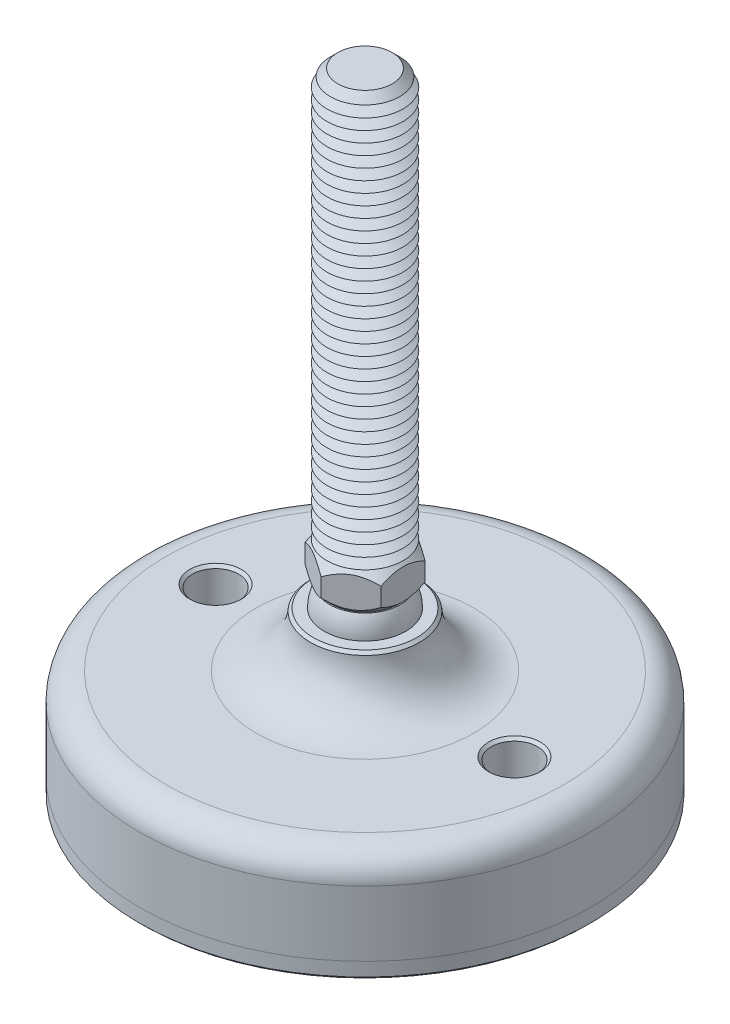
ISO-10303-21;
HEADER;
FILE_DESCRIPTION(('STEP AP214'),'2;1');
FILE_NAME('part.step','',(''),(''),'','','');
FILE_SCHEMA(('AUTOMOTIVE_DESIGN { 1 0 10303 214 1 1 1 1 }'));
ENDSEC;
DATA;
#1=APPLICATION_CONTEXT('core data for automotive mechanical design processes');
#2=APPLICATION_PROTOCOL_DEFINITION('international standard','automotive_design',2000,#1);
#3=PRODUCT_CONTEXT('',#1,'mechanical');
#4=PRODUCT('Part','Part','',(#3));
#5=PRODUCT_RELATED_PRODUCT_CATEGORY('part','',(#4));
#6=PRODUCT_DEFINITION_FORMATION('','',#4);
#7=PRODUCT_DEFINITION_CONTEXT('part definition',#1,'design');
#8=PRODUCT_DEFINITION('design','',#6,#7);
#9=PRODUCT_DEFINITION_SHAPE('','',#8);
#10=(LENGTH_UNIT() NAMED_UNIT(*) SI_UNIT(.MILLI.,.METRE.));
#11=(NAMED_UNIT(*) PLANE_ANGLE_UNIT() SI_UNIT($,.RADIAN.));
#12=(NAMED_UNIT(*) SI_UNIT($,.STERADIAN.) SOLID_ANGLE_UNIT());
#13=UNCERTAINTY_MEASURE_WITH_UNIT(LENGTH_MEASURE(1.E-05),#10,'distance_accuracy_value','');
#14=(GEOMETRIC_REPRESENTATION_CONTEXT(3) GLOBAL_UNCERTAINTY_ASSIGNED_CONTEXT((#13)) GLOBAL_UNIT_ASSIGNED_CONTEXT((#10,
#11,#12)) REPRESENTATION_CONTEXT('',''));
#15=CARTESIAN_POINT('',(0.,0.,0.));
#16=DIRECTION('',(0.,0.,1.));
#17=DIRECTION('',(1.,0.,0.));
#18=AXIS2_PLACEMENT_3D('',#15,#16,#17);
#19=CARTESIAN_POINT('',(0.,-27.,0.));
#20=DIRECTION('',(0.,1.,0.));
#21=DIRECTION('',(0.,0.,1.));
#22=AXIS2_PLACEMENT_3D('',#19,#20,#21);
#23=PLANE('',#22);
#24=CARTESIAN_POINT('',(-27.5,-27.,0.));
#25=DIRECTION('',(0.,1.,0.));
#26=DIRECTION('',(0.,0.,1.));
#27=AXIS2_PLACEMENT_3D('',#24,#25,#26);
#28=CIRCLE('',#27,4.25000000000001);
#29=CARTESIAN_POINT('',(-27.5,-27.,4.25000000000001));
#30=VERTEX_POINT('',#29);
#31=EDGE_CURVE('P0_E43',#30,#30,#28,.T.);
#32=ORIENTED_EDGE('',*,*,#31,.F.);
#33=EDGE_LOOP('',(#32));
#34=FACE_BOUND('',#33,.T.);
#35=CARTESIAN_POINT('',(27.5,-27.,0.));
#36=DIRECTION('',(0.,1.,0.));
#37=DIRECTION('',(0.,0.,1.));
#38=AXIS2_PLACEMENT_3D('',#35,#36,#37);
#39=CIRCLE('',#38,4.25000000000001);
#40=CARTESIAN_POINT('',(27.5,-27.,4.25000000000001));
#41=VERTEX_POINT('',#40);
#42=EDGE_CURVE('P0_E44',#41,#41,#39,.T.);
#43=ORIENTED_EDGE('',*,*,#42,.F.);
#44=EDGE_LOOP('',(#43));
#45=FACE_BOUND('',#44,.T.);
#46=CARTESIAN_POINT('',(0.,-27.,0.));
#47=DIRECTION('',(0.,1.,0.));
#48=DIRECTION('',(0.,0.,1.));
#49=AXIS2_PLACEMENT_3D('',#46,#47,#48);
#50=CIRCLE('',#49,41.5);
#51=CARTESIAN_POINT('',(0.,-27.,41.5));
#52=VERTEX_POINT('',#51);
#53=EDGE_CURVE('P0_E40',#52,#52,#50,.T.);
#54=ORIENTED_EDGE('',*,*,#53,.T.);
#55=EDGE_LOOP('',(#54));
#56=FACE_BOUND('',#55,.T.);
#57=ADVANCED_FACE('P0_F14',(#34,#45,#56),#23,.T.);
#58=CARTESIAN_POINT('',(0.,48.1654938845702,0.));
#59=DIRECTION('',(0.,1.,0.));
#60=DIRECTION('',(0.,0.,1.));
#61=AXIS2_PLACEMENT_3D('',#58,#59,#60);
#62=CYLINDRICAL_SURFACE('',#61,41.5);
#63=CARTESIAN_POINT('',(0.,-29.5,0.));
#64=DIRECTION('',(0.,-1.,0.));
#65=DIRECTION('',(0.,0.,-1.));
#66=AXIS2_PLACEMENT_3D('',#63,#64,#65);
#67=CIRCLE('',#66,41.5);
#68=CARTESIAN_POINT('',(0.,-29.5,-41.5));
#69=VERTEX_POINT('',#68);
#70=EDGE_CURVE('P0_E37',#69,#69,#67,.F.);
#71=ORIENTED_EDGE('',*,*,#70,.T.);
#72=EDGE_LOOP('',(#71));
#73=FACE_BOUND('',#72,.T.);
#74=ORIENTED_EDGE('',*,*,#53,.F.);
#75=EDGE_LOOP('',(#74));
#76=FACE_BOUND('',#75,.T.);
#77=ADVANCED_FACE('P0_F54',(#73,#76),#62,.T.);
#78=CARTESIAN_POINT('',(0.,-30.,41.5));
#79=DIRECTION('',(0.,-1.,0.));
#80=DIRECTION('',(0.,0.,-1.));
#81=AXIS2_PLACEMENT_3D('',#78,#79,#80);
#82=PLANE('',#81);
#83=CARTESIAN_POINT('',(27.5,-30.,0.));
#84=DIRECTION('',(0.,-1.,0.));
#85=DIRECTION('',(0.,0.,-1.));
#86=AXIS2_PLACEMENT_3D('',#83,#84,#85);
#87=CIRCLE('',#86,4.75);
#88=CARTESIAN_POINT('',(27.5,-30.,-4.75000000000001));
#89=VERTEX_POINT('',#88);
#90=EDGE_CURVE('P0_E25',#89,#89,#87,.F.);
#91=ORIENTED_EDGE('',*,*,#90,.T.);
#92=EDGE_LOOP('',(#91));
#93=FACE_BOUND('',#92,.T.);
#94=CARTESIAN_POINT('',(-27.5,-30.,0.));
#95=DIRECTION('',(0.,-1.,0.));
#96=DIRECTION('',(0.,0.,-1.));
#97=AXIS2_PLACEMENT_3D('',#94,#95,#96);
#98=CIRCLE('',#97,4.75);
#99=CARTESIAN_POINT('',(-27.5,-30.,-4.75));
#100=VERTEX_POINT('',#99);
#101=EDGE_CURVE('P0_E29',#100,#100,#98,.F.);
#102=ORIENTED_EDGE('',*,*,#101,.T.);
#103=EDGE_LOOP('',(#102));
#104=FACE_BOUND('',#103,.T.);
#105=CARTESIAN_POINT('',(0.,-30.,0.));
#106=DIRECTION('',(0.,-1.,0.));
#107=DIRECTION('',(0.,0.,-1.));
#108=AXIS2_PLACEMENT_3D('',#105,#106,#107);
#109=CIRCLE('',#108,41.);
#110=CARTESIAN_POINT('',(0.,-30.,-41.));
#111=VERTEX_POINT('',#110);
#112=EDGE_CURVE('P0_E34',#111,#111,#109,.T.);
#113=ORIENTED_EDGE('',*,*,#112,.T.);
#114=EDGE_LOOP('',(#113));
#115=FACE_BOUND('',#114,.T.);
#116=ADVANCED_FACE('P0_F61',(#93,#104,#115),#82,.T.);
#117=CARTESIAN_POINT('',(0.,-29.5,0.));
#118=DIRECTION('',(0.,1.,0.));
#119=DIRECTION('',(0.,0.,1.));
#120=AXIS2_PLACEMENT_3D('',#117,#118,#119);
#121=CONICAL_SURFACE('',#120,41.5,0.785398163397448);
#122=ORIENTED_EDGE('',*,*,#112,.F.);
#123=EDGE_LOOP('',(#122));
#124=FACE_BOUND('',#123,.T.);
#125=ORIENTED_EDGE('',*,*,#70,.F.);
#126=EDGE_LOOP('',(#125));
#127=FACE_BOUND('',#126,.T.);
#128=ADVANCED_FACE('P0_F68',(#124,#127),#121,.T.);
#129=CARTESIAN_POINT('',(27.5,-30.,0.));
#130=DIRECTION('',(0.,1.,0.));
#131=DIRECTION('',(0.,0.,1.));
#132=AXIS2_PLACEMENT_3D('',#129,#130,#131);
#133=CYLINDRICAL_SURFACE('',#132,4.25000000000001);
#134=CARTESIAN_POINT('',(27.5,-29.5,0.));
#135=DIRECTION('',(0.,-1.,0.));
#136=DIRECTION('',(0.,0.,-1.));
#137=AXIS2_PLACEMENT_3D('',#134,#135,#136);
#138=CIRCLE('',#137,4.25000000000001);
#139=CARTESIAN_POINT('',(27.5,-29.5,-4.25000000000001));
#140=VERTEX_POINT('',#139);
#141=EDGE_CURVE('P0_E21',#140,#140,#138,.T.);
#142=ORIENTED_EDGE('',*,*,#141,.T.);
#143=EDGE_LOOP('',(#142));
#144=FACE_BOUND('',#143,.T.);
#145=ORIENTED_EDGE('',*,*,#42,.T.);
#146=EDGE_LOOP('',(#145));
#147=FACE_BOUND('',#146,.T.);
#148=ADVANCED_FACE('P0_F74',(#144,#147),#133,.F.);
#149=CARTESIAN_POINT('',(-27.5,-30.,0.));
#150=DIRECTION('',(0.,1.,0.));
#151=DIRECTION('',(0.,0.,1.));
#152=AXIS2_PLACEMENT_3D('',#149,#150,#151);
#153=CYLINDRICAL_SURFACE('',#152,4.25000000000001);
#154=CARTESIAN_POINT('',(-27.5,-29.5,0.));
#155=DIRECTION('',(0.,-1.,0.));
#156=DIRECTION('',(0.,0.,-1.));
#157=AXIS2_PLACEMENT_3D('',#154,#155,#156);
#158=CIRCLE('',#157,4.25000000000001);
#159=CARTESIAN_POINT('',(-27.5,-29.5,-4.25000000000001));
#160=VERTEX_POINT('',#159);
#161=EDGE_CURVE('P0_E10',#160,#160,#158,.T.);
#162=ORIENTED_EDGE('',*,*,#161,.T.);
#163=EDGE_LOOP('',(#162));
#164=FACE_BOUND('',#163,.T.);
#165=ORIENTED_EDGE('',*,*,#31,.T.);
#166=EDGE_LOOP('',(#165));
#167=FACE_BOUND('',#166,.T.);
#168=ADVANCED_FACE('P0_F50',(#164,#167),#153,.F.);
#169=CARTESIAN_POINT('',(27.5,-30.,0.));
#170=DIRECTION('',(0.,-1.,0.));
#171=DIRECTION('',(0.,0.,-1.));
#172=AXIS2_PLACEMENT_3D('',#169,#170,#171);
#173=CONICAL_SURFACE('',#172,4.75,0.785398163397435);
#174=ORIENTED_EDGE('',*,*,#141,.F.);
#175=EDGE_LOOP('',(#174));
#176=FACE_BOUND('',#175,.T.);
#177=ORIENTED_EDGE('',*,*,#90,.F.);
#178=EDGE_LOOP('',(#177));
#179=FACE_BOUND('',#178,.T.);
#180=ADVANCED_FACE('P0_F76',(#176,#179),#173,.F.);
#181=CARTESIAN_POINT('',(-27.5,-30.,0.));
#182=DIRECTION('',(0.,-1.,0.));
#183=DIRECTION('',(0.,0.,-1.));
#184=AXIS2_PLACEMENT_3D('',#181,#182,#183);
#185=CONICAL_SURFACE('',#184,4.75,0.785398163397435);
#186=ORIENTED_EDGE('',*,*,#161,.F.);
#187=EDGE_LOOP('',(#186));
#188=FACE_BOUND('',#187,.T.);
#189=ORIENTED_EDGE('',*,*,#101,.F.);
#190=EDGE_LOOP('',(#189));
#191=FACE_BOUND('',#190,.T.);
#192=ADVANCED_FACE('P0_F16',(#188,#191),#185,.F.);
#193=CLOSED_SHELL('',(#57,#77,#116,#128,#148,#168,#180,#192));
#194=MANIFOLD_SOLID_BREP('P0_B1',#193);
#195=CARTESIAN_POINT('',(0.,0.,0.));
#196=DIRECTION('',(0.,1.,0.));
#197=DIRECTION('',(0.,0.,-1.));
#198=AXIS2_PLACEMENT_3D('',#195,#196,#197);
#199=SPHERICAL_SURFACE('',#198,7.5);
#200=CARTESIAN_POINT('',(0.,3.75,0.));
#201=DIRECTION('',(0.,-1.,0.));
#202=DIRECTION('',(0.,0.,-1.));
#203=AXIS2_PLACEMENT_3D('',#200,#201,#202);
#204=CIRCLE('',#203,6.49519052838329);
#205=CARTESIAN_POINT('',(0.,3.75,-6.49519052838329));
#206=VERTEX_POINT('',#205);
#207=EDGE_CURVE('P1_E209',#206,#206,#204,.F.);
#208=ORIENTED_EDGE('',*,*,#207,.F.);
#209=EDGE_LOOP('',(#208));
#210=FACE_BOUND('',#209,.T.);
#211=ADVANCED_FACE('P1_F16',(#210),#199,.T.);
#212=CARTESIAN_POINT('',(0.,3.75,0.));
#213=DIRECTION('',(0.,1.,0.));
#214=DIRECTION('',(0.,0.,1.));
#215=AXIS2_PLACEMENT_3D('',#212,#213,#214);
#216=CONICAL_SURFACE('',#215,6.26419292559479,0.785398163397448);
#217=CARTESIAN_POINT('',(0.,3.75,0.));
#218=DIRECTION('',(0.,1.,0.));
#219=DIRECTION('',(0.,0.,1.));
#220=AXIS2_PLACEMENT_3D('',#217,#218,#219);
#221=CIRCLE('',#220,6.26419292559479);
#222=CARTESIAN_POINT('',(0.,3.75,6.26419292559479));
#223=VERTEX_POINT('',#222);
#224=EDGE_CURVE('P1_E213',#223,#223,#221,.T.);
#225=ORIENTED_EDGE('',*,*,#224,.T.);
#226=EDGE_LOOP('',(#225));
#227=FACE_BOUND('',#226,.T.);
#228=CARTESIAN_POINT('',(-7.,8.22175145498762,-8.1400553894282));
#229=CARTESIAN_POINT('',(-7.,8.07177748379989,-7.94220937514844));
#230=CARTESIAN_POINT('',(-7.,7.92322959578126,-7.74326459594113));
#231=CARTESIAN_POINT('',(-7.,7.62962733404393,-7.34274065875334));
#232=CARTESIAN_POINT('',(-7.,7.48457383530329,-7.14116086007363));
#233=CARTESIAN_POINT('',(-7.,7.19756981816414,-6.73345531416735));
#234=CARTESIAN_POINT('',(-7.,7.05565202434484,-6.52730645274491));
#235=CARTESIAN_POINT('',(-7.,6.77703382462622,-6.11152362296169));
#236=CARTESIAN_POINT('',(-7.,6.64033305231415,-5.90188990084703));
#237=CARTESIAN_POINT('',(-7.,6.36550740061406,-5.46619755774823));
#238=CARTESIAN_POINT('',(-7.,6.22776674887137,-5.23989534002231));
#239=CARTESIAN_POINT('',(-7.,5.96123372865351,-4.78200028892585));
#240=CARTESIAN_POINT('',(-7.,5.83244279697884,-4.55040661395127));
#241=CARTESIAN_POINT('',(-7.,5.58658047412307,-4.08193183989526));
#242=CARTESIAN_POINT('',(-7.,5.46947462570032,-3.8450689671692));
#243=CARTESIAN_POINT('',(-7.,5.24960465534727,-3.36483104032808));
#244=CARTESIAN_POINT('',(-7.,5.14683397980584,-3.12145902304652));
#245=CARTESIAN_POINT('',(-7.,4.96723655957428,-2.64866791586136));
#246=CARTESIAN_POINT('',(-7.,4.88895097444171,-2.41980876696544));
#247=CARTESIAN_POINT('',(-7.,4.75072959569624,-1.9565107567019));
#248=CARTESIAN_POINT('',(-7.,4.69079504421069,-1.72207151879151));
#249=CARTESIAN_POINT('',(-7.,4.59342684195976,-1.25295119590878));
#250=CARTESIAN_POINT('',(-7.,4.5556027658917,-1.01835249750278));
#251=CARTESIAN_POINT('',(-7.,4.50320231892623,-0.546559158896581));
#252=CARTESIAN_POINT('',(-7.,4.48862178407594,-0.309364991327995));
#253=CARTESIAN_POINT('',(-7.,4.48382612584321,0.156313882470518));
#254=CARTESIAN_POINT('',(-7.,4.49271264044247,0.384789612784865));
#255=CARTESIAN_POINT('',(-7.,4.53235928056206,0.839822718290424));
#256=CARTESIAN_POINT('',(-7.,4.56312150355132,1.06637990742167));
#257=CARTESIAN_POINT('',(-7.,4.64535130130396,1.51976805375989));
#258=CARTESIAN_POINT('',(-7.,4.69717402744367,1.74653354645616));
#259=CARTESIAN_POINT('',(-7.,4.81873728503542,2.19511331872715));
#260=CARTESIAN_POINT('',(-7.,4.88847641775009,2.41692798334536));
#261=CARTESIAN_POINT('',(-7.,5.04951755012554,2.87389766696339));
#262=CARTESIAN_POINT('',(-7.,5.14215063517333,3.10857869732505));
#263=CARTESIAN_POINT('',(-7.,5.3416605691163,3.57185972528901));
#264=CARTESIAN_POINT('',(-7.,5.44854400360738,3.80045685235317));
#265=CARTESIAN_POINT('',(-7.,5.6740138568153,4.25267813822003));
#266=CARTESIAN_POINT('',(-7.,5.79263686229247,4.47628390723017));
#267=CARTESIAN_POINT('',(-7.,6.03896666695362,4.91835509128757));
#268=CARTESIAN_POINT('',(-7.,6.16667203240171,5.13682131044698));
#269=CARTESIAN_POINT('',(-7.,6.4228595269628,5.55855563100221));
#270=CARTESIAN_POINT('',(-7.,6.55098806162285,5.76203966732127));
#271=CARTESIAN_POINT('',(-7.,6.81264959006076,6.16551366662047));
#272=CARTESIAN_POINT('',(-7.,6.94618299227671,6.36550336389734));
#273=CARTESIAN_POINT('',(-7.,7.21658951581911,6.76082742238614));
#274=CARTESIAN_POINT('',(-7.,7.35342681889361,6.95618637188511));
#275=CARTESIAN_POINT('',(-7.,7.6307324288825,7.34423185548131));
#276=CARTESIAN_POINT('',(-7.,7.77119972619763,7.53691911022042));
#277=CARTESIAN_POINT('',(-7.,7.91315155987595,7.72848711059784));
#278=B_SPLINE_CURVE_WITH_KNOTS('',3,(#228,#229,#230,#231,#232,#233,#234,#235,#236,#237,#238,
#239,#240,#241,#242,#243,#244,#245,#246,#247,#248,#249,#250,#251,#252,#253,#254,#255,#256,#257,
#258,#259,#260,#261,#262,#263,#264,#265,#266,#267,#268,#269,#270,#271,#272,#273,#274,#275,#276,
#277),.UNSPECIFIED.,.F.,.F.,(4,2,2,2,2,2,2,2,2,2,2,2,2,2,2,2,2,2,2,2,2,2,2,2,4),(0.,
0.744807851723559,1.48980030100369,2.2405614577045,2.99126978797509,3.78587980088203,
4.58061708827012,5.37293691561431,6.16489332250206,6.88989369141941,7.61494312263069,
8.32676947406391,9.0384682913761,9.72332048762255,10.4082383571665,11.1052200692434,
11.8021473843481,12.5584650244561,13.3151334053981,14.0742390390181,14.8332251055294,
15.5545151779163,16.2758598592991,16.9913609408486,17.7066651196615),.UNSPECIFIED.);
#279=CARTESIAN_POINT('',(-7.,5.56871084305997,-4.04145188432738));
#280=VERTEX_POINT('',#279);
#281=CARTESIAN_POINT('',(-7.,5.56871084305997,4.04145188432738));
#282=VERTEX_POINT('',#281);
#283=EDGE_CURVE('P1_E25',#280,#282,#278,.T.);
#284=ORIENTED_EDGE('',*,*,#283,.F.);
#285=CARTESIAN_POINT('',(0.000199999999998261,5.56882631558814,-8.0830192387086));
#286=CARTESIAN_POINT('',(-0.120159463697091,5.49934419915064,-8.01352966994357));
#287=CARTESIAN_POINT('',(-0.241444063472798,5.43199440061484,-7.94350597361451));
#288=CARTESIAN_POINT('',(-0.486045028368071,5.30220807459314,-7.80228554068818));
#289=CARTESIAN_POINT('',(-0.60936245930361,5.2397742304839,-7.73108818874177));
#290=CARTESIAN_POINT('',(-0.983781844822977,5.06028719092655,-7.51491705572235));
#291=CARTESIAN_POINT('',(-1.23805341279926,4.95181416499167,-7.36811329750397));
#292=CARTESIAN_POINT('',(-1.75081233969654,4.76606165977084,-7.07207179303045));
#293=CARTESIAN_POINT('',(-2.00916864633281,4.68831421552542,-6.92290970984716));
#294=CARTESIAN_POINT('',(-2.40095049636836,4.59837958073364,-6.69671435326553));
#295=CARTESIAN_POINT('',(-2.53212124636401,4.57286115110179,-6.62098288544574));
#296=CARTESIAN_POINT('',(-2.79557335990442,4.53129725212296,-6.4688787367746));
#297=CARTESIAN_POINT('',(-2.92785455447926,4.5152503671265,-6.39250615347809));
#298=CARTESIAN_POINT('',(-3.25020698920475,4.48834537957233,-6.2063958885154));
#299=CARTESIAN_POINT('',(-3.44062555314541,4.48270029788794,-6.09645767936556));
#300=CARTESIAN_POINT('',(-3.82111946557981,4.49217587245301,-5.87677941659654));
#301=CARTESIAN_POINT('',(-4.01119467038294,4.5073038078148,-5.76703944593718));
#302=CARTESIAN_POINT('',(-4.38955306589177,4.55743368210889,-5.54859412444));
#303=CARTESIAN_POINT('',(-4.57783401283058,4.5924578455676,-5.43989006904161));
#304=CARTESIAN_POINT('',(-4.95115981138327,4.68047604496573,-5.22435031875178));
#305=CARTESIAN_POINT('',(-5.13620490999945,4.73346870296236,-5.1175144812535));
#306=CARTESIAN_POINT('',(-5.46469033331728,4.84248989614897,-4.92786333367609));
#307=CARTESIAN_POINT('',(-5.6088580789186,4.89565100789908,-4.8446280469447));
#308=CARTESIAN_POINT('',(-5.8946056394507,5.0105398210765,-4.67965161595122));
#309=CARTESIAN_POINT('',(-6.03618537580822,5.07226778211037,-4.5979105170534));
#310=CARTESIAN_POINT('',(-6.31631098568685,5.20290661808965,-4.43617992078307));
#311=CARTESIAN_POINT('',(-6.4548648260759,5.27179490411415,-4.3561858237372));
#312=CARTESIAN_POINT('',(-6.72940692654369,5.41585000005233,-4.19767886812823));
#313=CARTESIAN_POINT('',(-6.86539669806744,5.49101295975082,-4.11916513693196));
#314=CARTESIAN_POINT('',(-7.0002,5.56882631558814,-4.04133641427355));
#315=B_SPLINE_CURVE_WITH_KNOTS('',3,(#285,#286,#287,#288,#289,#290,#291,#292,#293,#294,#295,
#296,#297,#298,#299,#300,#301,#302,#303,#304,#305,#306,#307,#308,#309,#310,#311,#312,#313,#314),
.UNSPECIFIED.,.F.,.F.,(4,2,2,2,2,2,2,2,2,2,2,2,2,2,4),(0.,0.466112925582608,0.932478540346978,
1.87024464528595,2.79312018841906,3.25365289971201,3.71411676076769,4.37293813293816,
5.03199042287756,5.69178034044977,6.35151967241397,6.8755322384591,7.39956068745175,
7.92198344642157,8.44408796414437),.UNSPECIFIED.);
#316=CARTESIAN_POINT('',(0.,5.56871084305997,-8.08290376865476));
#317=VERTEX_POINT('',#316);
#318=EDGE_CURVE('P1_E114',#317,#280,#315,.T.);
#319=ORIENTED_EDGE('',*,*,#318,.F.);
#320=CARTESIAN_POINT('',(7.00019999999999,5.56882631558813,-4.04133641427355));
#321=CARTESIAN_POINT('',(6.8798405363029,5.49934419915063,-4.11082598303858));
#322=CARTESIAN_POINT('',(6.7585559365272,5.43199440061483,-4.18084967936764));
#323=CARTESIAN_POINT('',(6.51395497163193,5.30220807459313,-4.32207011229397));
#324=CARTESIAN_POINT('',(6.39063754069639,5.2397742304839,-4.39326746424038));
#325=CARTESIAN_POINT('',(6.01621815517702,5.06028719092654,-4.6094385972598));
#326=CARTESIAN_POINT('',(5.76194658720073,4.95181416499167,-4.75624235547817));
#327=CARTESIAN_POINT('',(5.24918766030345,4.76606165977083,-5.0522838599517));
#328=CARTESIAN_POINT('',(4.99083135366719,4.68831421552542,-5.20144594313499));
#329=CARTESIAN_POINT('',(4.59904950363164,4.59837958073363,-5.42764129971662));
#330=CARTESIAN_POINT('',(4.46787875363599,4.57286115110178,-5.50337276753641));
#331=CARTESIAN_POINT('',(4.20442664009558,4.53129725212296,-5.65547691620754));
#332=CARTESIAN_POINT('',(4.07214544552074,4.5152503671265,-5.73184949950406));
#333=CARTESIAN_POINT('',(3.74979301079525,4.48834537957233,-5.91795976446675));
#334=CARTESIAN_POINT('',(3.55937444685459,4.48270029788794,-6.02789797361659));
#335=CARTESIAN_POINT('',(3.17888053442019,4.49217587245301,-6.2475762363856));
#336=CARTESIAN_POINT('',(2.98880532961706,4.5073038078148,-6.35731620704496));
#337=CARTESIAN_POINT('',(2.61044693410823,4.55743368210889,-6.57576152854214));
#338=CARTESIAN_POINT('',(2.42216598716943,4.5924578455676,-6.68446558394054));
#339=CARTESIAN_POINT('',(2.04884018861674,4.68047604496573,-6.90000533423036));
#340=CARTESIAN_POINT('',(1.86379509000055,4.73346870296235,-7.00684117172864));
#341=CARTESIAN_POINT('',(1.53530966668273,4.84248989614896,-7.19649231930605));
#342=CARTESIAN_POINT('',(1.3911419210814,4.89565100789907,-7.27972760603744));
#343=CARTESIAN_POINT('',(1.1053943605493,5.0105398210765,-7.44470403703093));
#344=CARTESIAN_POINT('',(0.96381462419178,5.07226778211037,-7.52644513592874));
#345=CARTESIAN_POINT('',(0.683689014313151,5.20290661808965,-7.68817573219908));
#346=CARTESIAN_POINT('',(0.545135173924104,5.27179490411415,-7.76816982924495));
#347=CARTESIAN_POINT('',(0.270593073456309,5.41585000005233,-7.92667678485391));
#348=CARTESIAN_POINT('',(0.134603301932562,5.49101295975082,-8.00519051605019));
#349=CARTESIAN_POINT('',(-0.00020000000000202,5.56882631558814,-8.0830192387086));
#350=B_SPLINE_CURVE_WITH_KNOTS('',3,(#320,#321,#322,#323,#324,#325,#326,#327,#328,#329,#330,
#331,#332,#333,#334,#335,#336,#337,#338,#339,#340,#341,#342,#343,#344,#345,#346,#347,#348,#349),
.UNSPECIFIED.,.F.,.F.,(4,2,2,2,2,2,2,2,2,2,2,2,2,2,4),(0.,0.466112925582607,0.932478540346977,
1.87024464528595,2.79312018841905,3.25365289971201,3.71411676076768,4.37293813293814,
5.03199042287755,5.69178034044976,6.35151967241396,6.87553223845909,7.39956068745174,
7.92198344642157,8.44408796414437),.UNSPECIFIED.);
#351=CARTESIAN_POINT('',(7.,5.56871084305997,-4.04145188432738));
#352=VERTEX_POINT('',#351);
#353=EDGE_CURVE('P1_E121',#352,#317,#350,.T.);
#354=ORIENTED_EDGE('',*,*,#353,.F.);
#355=CARTESIAN_POINT('',(6.99999999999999,8.22175145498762,-8.1400553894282));
#356=CARTESIAN_POINT('',(6.99999999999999,8.07177748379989,-7.94220937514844));
#357=CARTESIAN_POINT('',(6.99999999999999,7.92322959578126,-7.74326459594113));
#358=CARTESIAN_POINT('',(6.99999999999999,7.62962733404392,-7.34274065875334));
#359=CARTESIAN_POINT('',(6.99999999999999,7.48457383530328,-7.14116086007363));
#360=CARTESIAN_POINT('',(6.99999999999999,7.19756981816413,-6.73345531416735));
#361=CARTESIAN_POINT('',(6.99999999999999,7.05565202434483,-6.52730645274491));
#362=CARTESIAN_POINT('',(6.99999999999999,6.77703382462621,-6.11152362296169));
#363=CARTESIAN_POINT('',(6.99999999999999,6.64033305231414,-5.90188990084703));
#364=CARTESIAN_POINT('',(6.99999999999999,6.36550740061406,-5.46619755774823));
#365=CARTESIAN_POINT('',(6.99999999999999,6.22776674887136,-5.23989534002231));
#366=CARTESIAN_POINT('',(6.99999999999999,5.9612337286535,-4.78200028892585));
#367=CARTESIAN_POINT('',(6.99999999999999,5.83244279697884,-4.55040661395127));
#368=CARTESIAN_POINT('',(6.99999999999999,5.58658047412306,-4.08193183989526));
#369=CARTESIAN_POINT('',(6.99999999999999,5.46947462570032,-3.8450689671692));
#370=CARTESIAN_POINT('',(6.99999999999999,5.24960465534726,-3.36483104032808));
#371=CARTESIAN_POINT('',(6.99999999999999,5.14683397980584,-3.12145902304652));
#372=CARTESIAN_POINT('',(6.99999999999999,4.96723655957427,-2.64866791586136));
#373=CARTESIAN_POINT('',(6.99999999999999,4.88895097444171,-2.41980876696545));
#374=CARTESIAN_POINT('',(6.99999999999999,4.75072959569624,-1.9565107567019));
#375=CARTESIAN_POINT('',(6.99999999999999,4.69079504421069,-1.72207151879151));
#376=CARTESIAN_POINT('',(6.99999999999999,4.59342684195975,-1.25295119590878));
#377=CARTESIAN_POINT('',(6.99999999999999,4.5556027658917,-1.01835249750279));
#378=CARTESIAN_POINT('',(6.99999999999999,4.50320231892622,-0.546559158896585));
#379=CARTESIAN_POINT('',(6.99999999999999,4.48862178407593,-0.309364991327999));
#380=CARTESIAN_POINT('',(6.99999999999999,4.48382612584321,0.156313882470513));
#381=CARTESIAN_POINT('',(6.99999999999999,4.49271264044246,0.38478961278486));
#382=CARTESIAN_POINT('',(6.99999999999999,4.53235928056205,0.83982271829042));
#383=CARTESIAN_POINT('',(6.99999999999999,4.56312150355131,1.06637990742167));
#384=CARTESIAN_POINT('',(6.99999999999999,4.64535130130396,1.51976805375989));
#385=CARTESIAN_POINT('',(6.99999999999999,4.69717402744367,1.74653354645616));
#386=CARTESIAN_POINT('',(6.99999999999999,4.81873728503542,2.19511331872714));
#387=CARTESIAN_POINT('',(7.,4.88847641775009,2.41692798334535));
#388=CARTESIAN_POINT('',(7.,5.04951755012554,2.87389766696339));
#389=CARTESIAN_POINT('',(7.,5.14215063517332,3.10857869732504));
#390=CARTESIAN_POINT('',(7.,5.34166056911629,3.571859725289));
#391=CARTESIAN_POINT('',(7.,5.44854400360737,3.80045685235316));
#392=CARTESIAN_POINT('',(7.,5.67401385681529,4.25267813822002));
#393=CARTESIAN_POINT('',(7.,5.79263686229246,4.47628390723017));
#394=CARTESIAN_POINT('',(7.,6.03896666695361,4.91835509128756));
#395=CARTESIAN_POINT('',(7.,6.1666720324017,5.13682131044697));
#396=CARTESIAN_POINT('',(7.,6.42285952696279,5.5585556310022));
#397=CARTESIAN_POINT('',(7.,6.55098806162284,5.76203966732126));
#398=CARTESIAN_POINT('',(7.,6.81264959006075,6.16551366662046));
#399=CARTESIAN_POINT('',(7.,6.9461829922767,6.36550336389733));
#400=CARTESIAN_POINT('',(7.,7.21658951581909,6.76082742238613));
#401=CARTESIAN_POINT('',(7.,7.3534268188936,6.9561863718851));
#402=CARTESIAN_POINT('',(7.,7.63073242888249,7.3442318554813));
#403=CARTESIAN_POINT('',(7.,7.77119972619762,7.53691911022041));
#404=CARTESIAN_POINT('',(7.,7.91315155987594,7.72848711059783));
#405=B_SPLINE_CURVE_WITH_KNOTS('',3,(#355,#356,#357,#358,#359,#360,#361,#362,#363,#364,#365,
#366,#367,#368,#369,#370,#371,#372,#373,#374,#375,#376,#377,#378,#379,#380,#381,#382,#383,#384,
#385,#386,#387,#388,#389,#390,#391,#392,#393,#394,#395,#396,#397,#398,#399,#400,#401,#402,#403,
#404),.UNSPECIFIED.,.F.,.F.,(4,2,2,2,2,2,2,2,2,2,2,2,2,2,2,2,2,2,2,2,2,2,2,2,4),(0.,
0.744807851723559,1.48980030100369,2.2405614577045,2.9912697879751,3.78587980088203,
4.58061708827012,5.3729369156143,6.16489332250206,6.8898936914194,7.61494312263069,
8.32676947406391,9.03846829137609,9.72332048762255,10.4082383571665,11.1052200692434,
11.8021473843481,12.5584650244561,13.3151334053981,14.0742390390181,14.8332251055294,
15.5545151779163,16.275859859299,16.9913609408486,17.7066651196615),.UNSPECIFIED.);
#406=CARTESIAN_POINT('',(6.99999999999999,5.56871084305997,4.04145188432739));
#407=VERTEX_POINT('',#406);
#408=EDGE_CURVE('P1_E71',#407,#352,#405,.F.);
#409=ORIENTED_EDGE('',*,*,#408,.F.);
#410=CARTESIAN_POINT('',(-0.000200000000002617,5.56882631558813,8.0830192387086));
#411=CARTESIAN_POINT('',(0.120159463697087,5.49934419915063,8.01352966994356));
#412=CARTESIAN_POINT('',(0.241444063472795,5.43199440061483,7.9435059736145));
#413=CARTESIAN_POINT('',(0.486045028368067,5.30220807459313,7.80228554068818));
#414=CARTESIAN_POINT('',(0.609362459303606,5.2397742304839,7.73108818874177));
#415=CARTESIAN_POINT('',(0.983781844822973,5.06028719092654,7.51491705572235));
#416=CARTESIAN_POINT('',(1.23805341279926,4.95181416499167,7.36811329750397));
#417=CARTESIAN_POINT('',(1.75081233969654,4.76606165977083,7.07207179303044));
#418=CARTESIAN_POINT('',(2.00916864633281,4.68831421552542,6.92290970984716));
#419=CARTESIAN_POINT('',(2.40095049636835,4.59837958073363,6.69671435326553));
#420=CARTESIAN_POINT('',(2.53212124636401,4.57286115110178,6.62098288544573));
#421=CARTESIAN_POINT('',(2.79557335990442,4.53129725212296,6.4688787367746));
#422=CARTESIAN_POINT('',(2.92785455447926,4.5152503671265,6.39250615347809));
#423=CARTESIAN_POINT('',(3.25020698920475,4.48834537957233,6.2063958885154));
#424=CARTESIAN_POINT('',(3.44062555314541,4.48270029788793,6.09645767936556));
#425=CARTESIAN_POINT('',(3.82111946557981,4.492175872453,5.87677941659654));
#426=CARTESIAN_POINT('',(4.01119467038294,4.5073038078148,5.76703944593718));
#427=CARTESIAN_POINT('',(4.38955306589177,4.55743368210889,5.54859412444));
#428=CARTESIAN_POINT('',(4.57783401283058,4.5924578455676,5.4398900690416));
#429=CARTESIAN_POINT('',(4.95115981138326,4.68047604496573,5.22435031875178));
#430=CARTESIAN_POINT('',(5.13620490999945,4.73346870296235,5.1175144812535));
#431=CARTESIAN_POINT('',(5.46469033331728,4.84248989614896,4.92786333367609));
#432=CARTESIAN_POINT('',(5.6088580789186,4.89565100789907,4.8446280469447));
#433=CARTESIAN_POINT('',(5.8946056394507,5.01053982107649,4.67965161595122));
#434=CARTESIAN_POINT('',(6.03618537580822,5.07226778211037,4.5979105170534));
#435=CARTESIAN_POINT('',(6.31631098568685,5.20290661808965,4.43617992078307));
#436=CARTESIAN_POINT('',(6.45486482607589,5.27179490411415,4.3561858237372));
#437=CARTESIAN_POINT('',(6.72940692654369,5.41585000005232,4.19767886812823));
#438=CARTESIAN_POINT('',(6.86539669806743,5.49101295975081,4.11916513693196));
#439=CARTESIAN_POINT('',(7.00019999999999,5.56882631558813,4.04133641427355));
#440=B_SPLINE_CURVE_WITH_KNOTS('',3,(#410,#411,#412,#413,#414,#415,#416,#417,#418,#419,#420,
#421,#422,#423,#424,#425,#426,#427,#428,#429,#430,#431,#432,#433,#434,#435,#436,#437,#438,#439),
.UNSPECIFIED.,.F.,.F.,(4,2,2,2,2,2,2,2,2,2,2,2,2,2,4),(0.,0.466112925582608,0.932478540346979,
1.87024464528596,2.79312018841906,3.25365289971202,3.71411676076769,4.37293813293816,
5.03199042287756,5.69178034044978,6.35151967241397,6.8755322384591,7.39956068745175,
7.92198344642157,8.44408796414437),.UNSPECIFIED.);
#441=CARTESIAN_POINT('',(0.,5.56871084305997,8.08290376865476));
#442=VERTEX_POINT('',#441);
#443=EDGE_CURVE('P1_E68',#442,#407,#440,.T.);
#444=ORIENTED_EDGE('',*,*,#443,.F.);
#445=CARTESIAN_POINT('',(-7.0002,5.56882631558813,4.04133641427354));
#446=CARTESIAN_POINT('',(-6.87984053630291,5.49934419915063,4.11082598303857));
#447=CARTESIAN_POINT('',(-6.7585559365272,5.43199440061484,4.18084967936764));
#448=CARTESIAN_POINT('',(-6.51395497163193,5.30220807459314,4.32207011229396));
#449=CARTESIAN_POINT('',(-6.39063754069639,5.2397742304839,4.39326746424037));
#450=CARTESIAN_POINT('',(-6.01621815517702,5.06028719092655,4.60943859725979));
#451=CARTESIAN_POINT('',(-5.76194658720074,4.95181416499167,4.75624235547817));
#452=CARTESIAN_POINT('',(-5.24918766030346,4.76606165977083,5.0522838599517));
#453=CARTESIAN_POINT('',(-4.99083135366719,4.68831421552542,5.20144594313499));
#454=CARTESIAN_POINT('',(-4.59904950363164,4.59837958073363,5.42764129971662));
#455=CARTESIAN_POINT('',(-4.46787875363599,4.57286115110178,5.50337276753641));
#456=CARTESIAN_POINT('',(-4.20442664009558,4.53129725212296,5.65547691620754));
#457=CARTESIAN_POINT('',(-4.07214544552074,4.5152503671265,5.73184949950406));
#458=CARTESIAN_POINT('',(-3.74979301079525,4.48834537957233,5.91795976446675));
#459=CARTESIAN_POINT('',(-3.55937444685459,4.48270029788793,6.02789797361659));
#460=CARTESIAN_POINT('',(-3.17888053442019,4.492175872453,6.2475762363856));
#461=CARTESIAN_POINT('',(-2.98880532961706,4.5073038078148,6.35731620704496));
#462=CARTESIAN_POINT('',(-2.61044693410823,4.55743368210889,6.57576152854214));
#463=CARTESIAN_POINT('',(-2.42216598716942,4.5924578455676,6.68446558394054));
#464=CARTESIAN_POINT('',(-2.04884018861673,4.68047604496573,6.90000533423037));
#465=CARTESIAN_POINT('',(-1.86379509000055,4.73346870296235,7.00684117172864));
#466=CARTESIAN_POINT('',(-1.53530966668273,4.84248989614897,7.19649231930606));
#467=CARTESIAN_POINT('',(-1.3911419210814,4.89565100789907,7.27972760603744));
#468=CARTESIAN_POINT('',(-1.1053943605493,5.01053982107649,7.44470403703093));
#469=CARTESIAN_POINT('',(-0.963814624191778,5.07226778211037,7.52644513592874));
#470=CARTESIAN_POINT('',(-0.683689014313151,5.20290661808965,7.68817573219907));
#471=CARTESIAN_POINT('',(-0.545135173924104,5.27179490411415,7.76816982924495));
#472=CARTESIAN_POINT('',(-0.270593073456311,5.41585000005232,7.92667678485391));
#473=CARTESIAN_POINT('',(-0.134603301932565,5.49101295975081,8.00519051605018));
#474=CARTESIAN_POINT('',(0.000199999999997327,5.56882631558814,8.0830192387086));
#475=B_SPLINE_CURVE_WITH_KNOTS('',3,(#445,#446,#447,#448,#449,#450,#451,#452,#453,#454,#455,
#456,#457,#458,#459,#460,#461,#462,#463,#464,#465,#466,#467,#468,#469,#470,#471,#472,#473,#474),
.UNSPECIFIED.,.F.,.F.,(4,2,2,2,2,2,2,2,2,2,2,2,2,2,4),(0.,0.466112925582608,0.93247854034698,
1.87024464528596,2.79312018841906,3.25365289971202,3.71411676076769,4.37293813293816,
5.03199042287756,5.69178034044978,6.35151967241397,6.8755322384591,7.39956068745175,
7.92198344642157,8.44408796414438),.UNSPECIFIED.);
#476=EDGE_CURVE('P1_E40',#282,#442,#475,.T.);
#477=ORIENTED_EDGE('',*,*,#476,.F.);
#478=EDGE_LOOP('',(#284,#319,#354,#409,#444,#477));
#479=FACE_BOUND('',#478,.T.);
#480=ADVANCED_FACE('P1_F69',(#227,#479),#216,.T.);
#481=CARTESIAN_POINT('',(0.,3.75,6.26419292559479));
#482=DIRECTION('',(0.,-1.,0.));
#483=DIRECTION('',(0.,0.,-1.));
#484=AXIS2_PLACEMENT_3D('',#481,#482,#483);
#485=PLANE('',#484);
#486=ORIENTED_EDGE('',*,*,#207,.T.);
#487=EDGE_LOOP('',(#486));
#488=FACE_BOUND('',#487,.T.);
#489=ORIENTED_EDGE('',*,*,#224,.F.);
#490=EDGE_LOOP('',(#489));
#491=FACE_BOUND('',#490,.T.);
#492=ADVANCED_FACE('P1_F106',(#488,#491),#485,.F.);
#493=CARTESIAN_POINT('',(-7.,11.,4.04145188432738));
#494=DIRECTION('',(0.5,0.,-0.866025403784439));
#495=DIRECTION('',(-0.866025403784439,0.,-0.5));
#496=AXIS2_PLACEMENT_3D('',#493,#494,#495);
#497=PLANE('',#496);
#498=DIRECTION('',(0.,-1.,0.));
#499=VECTOR('',#498,1.);
#500=CARTESIAN_POINT('',(0.,11.,8.08290376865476));
#501=LINE('',#500,#499);
#502=CARTESIAN_POINT('',(0.,8.97927405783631,8.08290376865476));
#503=VERTEX_POINT('',#502);
#504=EDGE_CURVE('P1_E82',#503,#442,#501,.T.);
#505=ORIENTED_EDGE('',*,*,#504,.F.);
#506=CARTESIAN_POINT('',(0.000199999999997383,8.97915858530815,8.0830192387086));
#507=CARTESIAN_POINT('',(-0.120159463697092,9.04864070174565,8.01352966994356));
#508=CARTESIAN_POINT('',(-0.241444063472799,9.11599050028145,7.9435059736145));
#509=CARTESIAN_POINT('',(-0.486045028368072,9.24577682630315,7.80228554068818));
#510=CARTESIAN_POINT('',(-0.609362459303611,9.30821067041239,7.73108818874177));
#511=CARTESIAN_POINT('',(-0.983781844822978,9.48769770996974,7.51491705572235));
#512=CARTESIAN_POINT('',(-1.23805341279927,9.59617073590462,7.36811329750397));
#513=CARTESIAN_POINT('',(-1.75081233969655,9.78192324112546,7.07207179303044));
#514=CARTESIAN_POINT('',(-2.00916864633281,9.85967068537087,6.92290970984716));
#515=CARTESIAN_POINT('',(-2.40095049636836,9.94960532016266,6.69671435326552));
#516=CARTESIAN_POINT('',(-2.53212124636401,9.9751237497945,6.62098288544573));
#517=CARTESIAN_POINT('',(-2.79557335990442,10.0166876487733,6.4688787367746));
#518=CARTESIAN_POINT('',(-2.92785455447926,10.0327345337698,6.39250615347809));
#519=CARTESIAN_POINT('',(-3.25020698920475,10.059639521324,6.2063958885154));
#520=CARTESIAN_POINT('',(-3.44062555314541,10.0652846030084,6.09645767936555));
#521=CARTESIAN_POINT('',(-3.82111946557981,10.0558090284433,5.87677941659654));
#522=CARTESIAN_POINT('',(-4.01119467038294,10.0406810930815,5.76703944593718));
#523=CARTESIAN_POINT('',(-4.38955306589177,9.9905512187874,5.54859412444));
#524=CARTESIAN_POINT('',(-4.57783401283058,9.95552705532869,5.4398900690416));
#525=CARTESIAN_POINT('',(-4.95115981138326,9.86750885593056,5.22435031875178));
#526=CARTESIAN_POINT('',(-5.13620490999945,9.81451619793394,5.1175144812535));
#527=CARTESIAN_POINT('',(-5.46469033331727,9.70549500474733,4.92786333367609));
#528=CARTESIAN_POINT('',(-5.6088580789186,9.65233389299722,4.8446280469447));
#529=CARTESIAN_POINT('',(-5.8946056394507,9.5374450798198,4.67965161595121));
#530=CARTESIAN_POINT('',(-6.03618537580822,9.47571711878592,4.5979105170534));
#531=CARTESIAN_POINT('',(-6.31631098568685,9.34507828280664,4.43617992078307));
#532=CARTESIAN_POINT('',(-6.4548648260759,9.27618999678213,4.35618582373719));
#533=CARTESIAN_POINT('',(-6.72940692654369,9.13213490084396,4.19767886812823));
#534=CARTESIAN_POINT('',(-6.86539669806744,9.05697194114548,4.11916513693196));
#535=CARTESIAN_POINT('',(-7.0002,8.97915858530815,4.04133641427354));
#536=B_SPLINE_CURVE_WITH_KNOTS('',3,(#506,#507,#508,#509,#510,#511,#512,#513,#514,#515,#516,
#517,#518,#519,#520,#521,#522,#523,#524,#525,#526,#527,#528,#529,#530,#531,#532,#533,#534,#535),
.UNSPECIFIED.,.F.,.F.,(4,2,2,2,2,2,2,2,2,2,2,2,2,2,4),(0.,0.466112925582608,0.932478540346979,
1.87024464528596,2.79312018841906,3.25365289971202,3.71411676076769,4.37293813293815,
5.03199042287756,5.69178034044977,6.35151967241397,6.87553223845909,7.39956068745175,
7.92198344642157,8.44408796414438),.UNSPECIFIED.);
#537=CARTESIAN_POINT('',(-7.,8.97927405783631,4.04145188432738));
#538=VERTEX_POINT('',#537);
#539=EDGE_CURVE('P1_E151',#503,#538,#536,.T.);
#540=ORIENTED_EDGE('',*,*,#539,.T.);
#541=DIRECTION('',(0.,-1.,0.));
#542=VECTOR('',#541,1.);
#543=CARTESIAN_POINT('',(-7.,11.,4.04145188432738));
#544=LINE('',#543,#542);
#545=EDGE_CURVE('P1_E84',#538,#282,#544,.T.);
#546=ORIENTED_EDGE('',*,*,#545,.T.);
#547=ORIENTED_EDGE('',*,*,#476,.T.);
#548=EDGE_LOOP('',(#505,#540,#546,#547));
#549=FACE_BOUND('',#548,.T.);
#550=ADVANCED_FACE('P1_F80',(#549),#497,.F.);
#551=CARTESIAN_POINT('',(0.,11.,8.08290376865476));
#552=DIRECTION('',(-0.5,0.,-0.866025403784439));
#553=DIRECTION('',(-0.866025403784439,0.,0.5));
#554=AXIS2_PLACEMENT_3D('',#551,#552,#553);
#555=PLANE('',#554);
#556=DIRECTION('',(0.,-1.,0.));
#557=VECTOR('',#556,1.);
#558=CARTESIAN_POINT('',(7.,11.,4.04145188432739));
#559=LINE('',#558,#557);
#560=CARTESIAN_POINT('',(7.,8.97927405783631,4.04145188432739));
#561=VERTEX_POINT('',#560);
#562=EDGE_CURVE('P1_E89',#561,#407,#559,.T.);
#563=ORIENTED_EDGE('',*,*,#562,.F.);
#564=CARTESIAN_POINT('',(7.0002,8.97915858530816,4.04133641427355));
#565=CARTESIAN_POINT('',(6.87984053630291,9.04864070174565,4.11082598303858));
#566=CARTESIAN_POINT('',(6.7585559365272,9.11599050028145,4.18084967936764));
#567=CARTESIAN_POINT('',(6.51395497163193,9.24577682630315,4.32207011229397));
#568=CARTESIAN_POINT('',(6.39063754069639,9.30821067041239,4.39326746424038));
#569=CARTESIAN_POINT('',(6.01621815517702,9.48769770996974,4.6094385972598));
#570=CARTESIAN_POINT('',(5.76194658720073,9.59617073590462,4.75624235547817));
#571=CARTESIAN_POINT('',(5.24918766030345,9.78192324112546,5.0522838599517));
#572=CARTESIAN_POINT('',(4.99083135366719,9.85967068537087,5.20144594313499));
#573=CARTESIAN_POINT('',(4.59904950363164,9.94960532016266,5.42764129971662));
#574=CARTESIAN_POINT('',(4.46787875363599,9.9751237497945,5.50337276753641));
#575=CARTESIAN_POINT('',(4.20442664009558,10.0166876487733,5.65547691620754));
#576=CARTESIAN_POINT('',(4.07214544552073,10.0327345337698,5.73184949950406));
#577=CARTESIAN_POINT('',(3.74979301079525,10.059639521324,5.91795976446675));
#578=CARTESIAN_POINT('',(3.55937444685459,10.0652846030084,6.02789797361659));
#579=CARTESIAN_POINT('',(3.17888053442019,10.0558090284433,6.2475762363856));
#580=CARTESIAN_POINT('',(2.98880532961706,10.0406810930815,6.35731620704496));
#581=CARTESIAN_POINT('',(2.61044693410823,9.9905512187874,6.57576152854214));
#582=CARTESIAN_POINT('',(2.42216598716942,9.95552705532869,6.68446558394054));
#583=CARTESIAN_POINT('',(2.04884018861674,9.86750885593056,6.90000533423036));
#584=CARTESIAN_POINT('',(1.86379509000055,9.81451619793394,7.00684117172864));
#585=CARTESIAN_POINT('',(1.53530966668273,9.70549500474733,7.19649231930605));
#586=CARTESIAN_POINT('',(1.3911419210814,9.65233389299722,7.27972760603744));
#587=CARTESIAN_POINT('',(1.1053943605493,9.5374450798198,7.44470403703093));
#588=CARTESIAN_POINT('',(0.963814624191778,9.47571711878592,7.52644513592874));
#589=CARTESIAN_POINT('',(0.683689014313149,9.34507828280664,7.68817573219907));
#590=CARTESIAN_POINT('',(0.545135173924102,9.27618999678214,7.76816982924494));
#591=CARTESIAN_POINT('',(0.270593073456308,9.13213490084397,7.92667678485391));
#592=CARTESIAN_POINT('',(0.134603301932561,9.05697194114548,8.00519051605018));
#593=CARTESIAN_POINT('',(-0.000200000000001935,8.97915858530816,8.0830192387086));
#594=B_SPLINE_CURVE_WITH_KNOTS('',3,(#564,#565,#566,#567,#568,#569,#570,#571,#572,#573,#574,
#575,#576,#577,#578,#579,#580,#581,#582,#583,#584,#585,#586,#587,#588,#589,#590,#591,#592,#593),
.UNSPECIFIED.,.F.,.F.,(4,2,2,2,2,2,2,2,2,2,2,2,2,2,4),(0.,0.466112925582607,0.932478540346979,
1.87024464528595,2.79312018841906,3.25365289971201,3.71411676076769,4.37293813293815,
5.03199042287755,5.69178034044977,6.35151967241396,6.87553223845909,7.39956068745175,
7.92198344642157,8.44408796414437),.UNSPECIFIED.);
#595=EDGE_CURVE('P1_E88',#561,#503,#594,.T.);
#596=ORIENTED_EDGE('',*,*,#595,.T.);
#597=ORIENTED_EDGE('',*,*,#504,.T.);
#598=ORIENTED_EDGE('',*,*,#443,.T.);
#599=EDGE_LOOP('',(#563,#596,#597,#598));
#600=FACE_BOUND('',#599,.T.);
#601=ADVANCED_FACE('P1_F87',(#600),#555,.F.);
#602=CARTESIAN_POINT('',(7.,11.,4.04145188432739));
#603=DIRECTION('',(-1.,0.,0.));
#604=DIRECTION('',(0.,0.,1.));
#605=AXIS2_PLACEMENT_3D('',#602,#603,#604);
#606=PLANE('',#605);
#607=DIRECTION('',(0.,-1.,0.));
#608=VECTOR('',#607,1.);
#609=CARTESIAN_POINT('',(6.99999999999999,11.,-4.04145188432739));
#610=LINE('',#609,#608);
#611=CARTESIAN_POINT('',(7.,8.97927405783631,-4.04145188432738));
#612=VERTEX_POINT('',#611);
#613=EDGE_CURVE('P1_E92',#612,#352,#610,.T.);
#614=ORIENTED_EDGE('',*,*,#613,.F.);
#615=CARTESIAN_POINT('',(6.99999999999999,6.38657431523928,-8.06030460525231));
#616=CARTESIAN_POINT('',(6.99999999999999,6.53472070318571,-7.86404504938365));
#617=CARTESIAN_POINT('',(6.99999999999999,6.68143506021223,-7.66668664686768));
#618=CARTESIAN_POINT('',(6.99999999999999,6.97135854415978,-7.26933868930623));
#619=CARTESIAN_POINT('',(6.99999999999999,7.1145667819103,-7.06934848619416));
#620=CARTESIAN_POINT('',(6.99999999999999,7.39785506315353,-6.66484054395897));
#621=CARTESIAN_POINT('',(6.99999999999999,7.53790227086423,-6.4602997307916));
#622=CARTESIAN_POINT('',(6.99999999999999,7.81276929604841,-6.04774624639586));
#623=CARTESIAN_POINT('',(6.99999999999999,7.94758948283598,-5.83973382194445));
#624=CARTESIAN_POINT('',(6.99999999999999,8.21836349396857,-5.40767991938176));
#625=CARTESIAN_POINT('',(6.99999999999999,8.35394167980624,-5.18340182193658));
#626=CARTESIAN_POINT('',(6.99999999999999,8.61617794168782,-4.72961052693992));
#627=CARTESIAN_POINT('',(6.99999999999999,8.74283460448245,-4.50009650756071));
#628=CARTESIAN_POINT('',(6.99999999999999,8.98449500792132,-4.03585471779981));
#629=CARTESIAN_POINT('',(6.99999999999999,9.09953301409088,-3.80114492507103));
#630=CARTESIAN_POINT('',(6.99999999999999,9.31538083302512,-3.32532417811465));
#631=CARTESIAN_POINT('',(6.99999999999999,9.41619708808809,-3.08421618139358));
#632=CARTESIAN_POINT('',(6.99999999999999,9.59261477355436,-2.61490679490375));
#633=CARTESIAN_POINT('',(6.99999999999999,9.66959244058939,-2.38722816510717));
#634=CARTESIAN_POINT('',(6.99999999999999,9.80528213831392,-1.92638931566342));
#635=CARTESIAN_POINT('',(6.99999999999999,9.86399291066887,-1.69322871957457));
#636=CARTESIAN_POINT('',(6.99999999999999,9.95910606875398,-1.22669621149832));
#637=CARTESIAN_POINT('',(6.99999999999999,9.9958906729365,-0.993403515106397));
#638=CARTESIAN_POINT('',(6.99999999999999,10.0464375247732,-0.524324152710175));
#639=CARTESIAN_POINT('',(6.99999999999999,10.0602037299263,-0.288537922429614));
#640=CARTESIAN_POINT('',(6.99999999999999,10.0636914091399,0.174669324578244));
#641=CARTESIAN_POINT('',(6.99999999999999,10.0542651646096,0.402084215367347));
#642=CARTESIAN_POINT('',(6.99999999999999,10.0137689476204,0.854966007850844));
#643=CARTESIAN_POINT('',(6.99999999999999,9.98269687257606,1.080432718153));
#644=CARTESIAN_POINT('',(6.99999999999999,9.90007567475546,1.53159825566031));
#645=CARTESIAN_POINT('',(6.99999999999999,9.84817808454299,1.75723223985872));
#646=CARTESIAN_POINT('',(6.99999999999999,9.72667364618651,2.20358388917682));
#647=CARTESIAN_POINT('',(7.,9.65706827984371,2.42430196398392));
#648=CARTESIAN_POINT('',(7.,9.49585307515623,2.88081008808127));
#649=CARTESIAN_POINT('',(7.,9.40279568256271,3.11608373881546));
#650=CARTESIAN_POINT('',(7.,9.20239444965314,3.58051976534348));
#651=CARTESIAN_POINT('',(7.,9.09504395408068,3.8096792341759));
#652=CARTESIAN_POINT('',(7.,8.86861061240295,4.26300681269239));
#653=CARTESIAN_POINT('',(7.,8.74949092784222,4.48715637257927));
#654=CARTESIAN_POINT('',(7.,8.50215207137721,4.93029722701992));
#655=CARTESIAN_POINT('',(7.,8.37393434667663,5.14928933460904));
#656=CARTESIAN_POINT('',(7.,8.11675254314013,5.57201416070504));
#657=CARTESIAN_POINT('',(7.,7.98814324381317,5.7759638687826));
#658=CARTESIAN_POINT('',(7.,7.72551640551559,6.1803619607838));
#659=CARTESIAN_POINT('',(7.,7.59149845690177,6.3808100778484));
#660=CARTESIAN_POINT('',(7.,7.32012806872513,6.77703781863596));
#661=CARTESIAN_POINT('',(7.,7.18281155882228,6.97284213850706));
#662=CARTESIAN_POINT('',(7.,6.90454718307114,7.36177489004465));
#663=CARTESIAN_POINT('',(7.,6.76360032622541,7.55490404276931));
#664=CARTESIAN_POINT('',(7.,6.62116922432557,7.74691297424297));
#665=B_SPLINE_CURVE_WITH_KNOTS('',3,(#615,#616,#617,#618,#619,#620,#621,#622,#623,#624,#625,
#626,#627,#628,#629,#630,#631,#632,#633,#634,#635,#636,#637,#638,#639,#640,#641,#642,#643,#644,
#645,#646,#647,#648,#649,#650,#651,#652,#653,#654,#655,#656,#657,#658,#659,#660,#661,#662,#663,
#664),.UNSPECIFIED.,.F.,.F.,(4,2,2,2,2,2,2,2,2,2,2,2,2,2,2,2,2,2,2,2,2,2,2,2,4),(0.,
0.73770456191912,1.47559431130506,2.21920144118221,2.96275593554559,3.74880908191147,
4.53498646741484,5.31877306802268,6.10220347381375,6.82258884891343,7.54302383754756,
8.2505020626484,8.95785864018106,9.63961191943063,10.3214314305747,11.0151699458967,
11.7088504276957,12.4672854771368,13.2260749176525,13.9873195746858,14.7484434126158,
15.4716843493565,16.1949801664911,16.912400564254,17.6296236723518),.UNSPECIFIED.);
#666=EDGE_CURVE('P1_E152',#612,#561,#665,.T.);
#667=ORIENTED_EDGE('',*,*,#666,.T.);
#668=ORIENTED_EDGE('',*,*,#562,.T.);
#669=ORIENTED_EDGE('',*,*,#408,.T.);
#670=EDGE_LOOP('',(#614,#667,#668,#669));
#671=FACE_BOUND('',#670,.T.);
#672=ADVANCED_FACE('P1_F142',(#671),#606,.F.);
#673=CARTESIAN_POINT('',(6.99999999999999,11.,-4.04145188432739));
#674=DIRECTION('',(-0.5,0.,0.866025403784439));
#675=DIRECTION('',(0.866025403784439,0.,0.5));
#676=AXIS2_PLACEMENT_3D('',#673,#674,#675);
#677=PLANE('',#676);
#678=DIRECTION('',(0.,-1.,0.));
#679=VECTOR('',#678,1.);
#680=CARTESIAN_POINT('',(0.,11.,-8.08290376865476));
#681=LINE('',#680,#679);
#682=CARTESIAN_POINT('',(0.,8.97927405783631,-8.08290376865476));
#683=VERTEX_POINT('',#682);
#684=EDGE_CURVE('P1_E891',#683,#317,#681,.T.);
#685=ORIENTED_EDGE('',*,*,#684,.F.);
#686=CARTESIAN_POINT('',(-0.000200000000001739,8.97915858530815,-8.0830192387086));
#687=CARTESIAN_POINT('',(0.120159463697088,9.04864070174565,-8.01352966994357));
#688=CARTESIAN_POINT('',(0.241444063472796,9.11599050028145,-7.94350597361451));
#689=CARTESIAN_POINT('',(0.48604502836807,9.24577682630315,-7.80228554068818));
#690=CARTESIAN_POINT('',(0.609362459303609,9.30821067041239,-7.73108818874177));
#691=CARTESIAN_POINT('',(0.983781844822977,9.48769770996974,-7.51491705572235));
#692=CARTESIAN_POINT('',(1.23805341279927,9.59617073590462,-7.36811329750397));
#693=CARTESIAN_POINT('',(1.75081233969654,9.78192324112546,-7.07207179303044));
#694=CARTESIAN_POINT('',(2.00916864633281,9.85967068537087,-6.92290970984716));
#695=CARTESIAN_POINT('',(2.40095049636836,9.94960532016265,-6.69671435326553));
#696=CARTESIAN_POINT('',(2.53212124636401,9.9751237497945,-6.62098288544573));
#697=CARTESIAN_POINT('',(2.79557335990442,10.0166876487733,-6.4688787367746));
#698=CARTESIAN_POINT('',(2.92785455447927,10.0327345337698,-6.39250615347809));
#699=CARTESIAN_POINT('',(3.25020698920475,10.059639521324,-6.2063958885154));
#700=CARTESIAN_POINT('',(3.44062555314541,10.0652846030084,-6.09645767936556));
#701=CARTESIAN_POINT('',(3.82111946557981,10.0558090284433,-5.87677941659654));
#702=CARTESIAN_POINT('',(4.01119467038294,10.0406810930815,-5.76703944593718));
#703=CARTESIAN_POINT('',(4.38955306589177,9.9905512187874,-5.54859412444));
#704=CARTESIAN_POINT('',(4.57783401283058,9.95552705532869,-5.4398900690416));
#705=CARTESIAN_POINT('',(4.95115981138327,9.86750885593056,-5.22435031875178));
#706=CARTESIAN_POINT('',(5.13620490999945,9.81451619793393,-5.1175144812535));
#707=CARTESIAN_POINT('',(5.46469033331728,9.70549500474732,-4.92786333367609));
#708=CARTESIAN_POINT('',(5.6088580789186,9.65233389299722,-4.8446280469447));
#709=CARTESIAN_POINT('',(5.8946056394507,9.5374450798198,-4.67965161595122));
#710=CARTESIAN_POINT('',(6.03618537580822,9.47571711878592,-4.5979105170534));
#711=CARTESIAN_POINT('',(6.31631098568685,9.34507828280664,-4.43617992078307));
#712=CARTESIAN_POINT('',(6.45486482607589,9.27618999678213,-4.3561858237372));
#713=CARTESIAN_POINT('',(6.72940692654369,9.13213490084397,-4.19767886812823));
#714=CARTESIAN_POINT('',(6.86539669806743,9.05697194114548,-4.11916513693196));
#715=CARTESIAN_POINT('',(7.00019999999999,8.97915858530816,-4.04133641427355));
#716=B_SPLINE_CURVE_WITH_KNOTS('',3,(#686,#687,#688,#689,#690,#691,#692,#693,#694,#695,#696,
#697,#698,#699,#700,#701,#702,#703,#704,#705,#706,#707,#708,#709,#710,#711,#712,#713,#714,#715),
.UNSPECIFIED.,.F.,.F.,(4,2,2,2,2,2,2,2,2,2,2,2,2,2,4),(0.,0.466112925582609,0.932478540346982,
1.87024464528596,2.79312018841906,3.25365289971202,3.7141167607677,4.37293813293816,
5.03199042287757,5.69178034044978,6.35151967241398,6.8755322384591,7.39956068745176,
7.92198344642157,8.44408796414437),.UNSPECIFIED.);
#717=EDGE_CURVE('P1_E182',#683,#612,#716,.T.);
#718=ORIENTED_EDGE('',*,*,#717,.T.);
#719=ORIENTED_EDGE('',*,*,#613,.T.);
#720=ORIENTED_EDGE('',*,*,#353,.T.);
#721=EDGE_LOOP('',(#685,#718,#719,#720));
#722=FACE_BOUND('',#721,.T.);
#723=ADVANCED_FACE('P1_F187',(#722),#677,.F.);
#724=CARTESIAN_POINT('',(0.,11.,-8.08290376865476));
#725=DIRECTION('',(0.5,0.,0.866025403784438));
#726=DIRECTION('',(0.866025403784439,0.,-0.5));
#727=AXIS2_PLACEMENT_3D('',#724,#725,#726);
#728=PLANE('',#727);
#729=DIRECTION('',(0.,-1.,0.));
#730=VECTOR('',#729,1.);
#731=CARTESIAN_POINT('',(-7.,11.,-4.04145188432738));
#732=LINE('',#731,#730);
#733=CARTESIAN_POINT('',(-7.,8.97927405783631,-4.04145188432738));
#734=VERTEX_POINT('',#733);
#735=EDGE_CURVE('P1_E893',#734,#280,#732,.T.);
#736=ORIENTED_EDGE('',*,*,#735,.F.);
#737=CARTESIAN_POINT('',(-7.0002,8.97915858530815,-4.04133641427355));
#738=CARTESIAN_POINT('',(-6.87984053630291,9.04864070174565,-4.11082598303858));
#739=CARTESIAN_POINT('',(-6.7585559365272,9.11599050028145,-4.18084967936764));
#740=CARTESIAN_POINT('',(-6.51395497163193,9.24577682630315,-4.32207011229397));
#741=CARTESIAN_POINT('',(-6.39063754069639,9.30821067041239,-4.39326746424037));
#742=CARTESIAN_POINT('',(-6.01621815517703,9.48769770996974,-4.6094385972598));
#743=CARTESIAN_POINT('',(-5.76194658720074,9.59617073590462,-4.75624235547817));
#744=CARTESIAN_POINT('',(-5.24918766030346,9.78192324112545,-5.0522838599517));
#745=CARTESIAN_POINT('',(-4.99083135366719,9.85967068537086,-5.20144594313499));
#746=CARTESIAN_POINT('',(-4.59904950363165,9.94960532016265,-5.42764129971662));
#747=CARTESIAN_POINT('',(-4.467878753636,9.9751237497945,-5.50337276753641));
#748=CARTESIAN_POINT('',(-4.20442664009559,10.0166876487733,-5.65547691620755));
#749=CARTESIAN_POINT('',(-4.07214544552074,10.0327345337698,-5.73184949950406));
#750=CARTESIAN_POINT('',(-3.74979301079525,10.059639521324,-5.91795976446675));
#751=CARTESIAN_POINT('',(-3.55937444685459,10.0652846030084,-6.02789797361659));
#752=CARTESIAN_POINT('',(-3.17888053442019,10.0558090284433,-6.24757623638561));
#753=CARTESIAN_POINT('',(-2.98880532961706,10.0406810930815,-6.35731620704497));
#754=CARTESIAN_POINT('',(-2.61044693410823,9.9905512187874,-6.57576152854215));
#755=CARTESIAN_POINT('',(-2.42216598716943,9.95552705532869,-6.68446558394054));
#756=CARTESIAN_POINT('',(-2.04884018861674,9.86750885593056,-6.90000533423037));
#757=CARTESIAN_POINT('',(-1.86379509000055,9.81451619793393,-7.00684117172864));
#758=CARTESIAN_POINT('',(-1.53530966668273,9.70549500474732,-7.19649231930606));
#759=CARTESIAN_POINT('',(-1.39114192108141,9.65233389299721,-7.27972760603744));
#760=CARTESIAN_POINT('',(-1.10539436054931,9.53744507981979,-7.44470403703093));
#761=CARTESIAN_POINT('',(-0.963814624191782,9.47571711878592,-7.52644513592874));
#762=CARTESIAN_POINT('',(-0.683689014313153,9.34507828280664,-7.68817573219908));
#763=CARTESIAN_POINT('',(-0.545135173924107,9.27618999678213,-7.76816982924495));
#764=CARTESIAN_POINT('',(-0.270593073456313,9.13213490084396,-7.92667678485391));
#765=CARTESIAN_POINT('',(-0.134603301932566,9.05697194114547,-8.00519051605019));
#766=CARTESIAN_POINT('',(0.000199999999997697,8.97915858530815,-8.0830192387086));
#767=B_SPLINE_CURVE_WITH_KNOTS('',3,(#737,#738,#739,#740,#741,#742,#743,#744,#745,#746,#747,
#748,#749,#750,#751,#752,#753,#754,#755,#756,#757,#758,#759,#760,#761,#762,#763,#764,#765,#766),
.UNSPECIFIED.,.F.,.F.,(4,2,2,2,2,2,2,2,2,2,2,2,2,2,4),(0.,0.466112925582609,0.932478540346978,
1.87024464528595,2.79312018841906,3.25365289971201,3.71411676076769,4.37293813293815,
5.03199042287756,5.69178034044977,6.35151967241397,6.87553223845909,7.39956068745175,
7.92198344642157,8.44408796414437),.UNSPECIFIED.);
#768=EDGE_CURVE('P1_E32',#734,#683,#767,.T.);
#769=ORIENTED_EDGE('',*,*,#768,.T.);
#770=ORIENTED_EDGE('',*,*,#684,.T.);
#771=ORIENTED_EDGE('',*,*,#318,.T.);
#772=EDGE_LOOP('',(#736,#769,#770,#771));
#773=FACE_BOUND('',#772,.T.);
#774=ADVANCED_FACE('P1_F190',(#773),#728,.F.);
#775=CARTESIAN_POINT('',(-7.,11.,-4.04145188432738));
#776=DIRECTION('',(1.,0.,0.));
#777=DIRECTION('',(0.,0.,-1.));
#778=AXIS2_PLACEMENT_3D('',#775,#776,#777);
#779=PLANE('',#778);
#780=ORIENTED_EDGE('',*,*,#545,.F.);
#781=CARTESIAN_POINT('',(-7.,6.38657431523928,-8.06030460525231));
#782=CARTESIAN_POINT('',(-7.,6.53472070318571,-7.86404504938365));
#783=CARTESIAN_POINT('',(-7.,6.68143506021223,-7.66668664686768));
#784=CARTESIAN_POINT('',(-7.,6.97135854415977,-7.26933868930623));
#785=CARTESIAN_POINT('',(-7.,7.11456678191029,-7.06934848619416));
#786=CARTESIAN_POINT('',(-7.,7.39785506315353,-6.66484054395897));
#787=CARTESIAN_POINT('',(-7.,7.53790227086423,-6.4602997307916));
#788=CARTESIAN_POINT('',(-7.,7.81276929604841,-6.04774624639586));
#789=CARTESIAN_POINT('',(-7.,7.94758948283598,-5.83973382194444));
#790=CARTESIAN_POINT('',(-7.,8.21836349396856,-5.40767991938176));
#791=CARTESIAN_POINT('',(-7.,8.35394167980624,-5.18340182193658));
#792=CARTESIAN_POINT('',(-7.,8.61617794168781,-4.72961052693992));
#793=CARTESIAN_POINT('',(-7.,8.74283460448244,-4.50009650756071));
#794=CARTESIAN_POINT('',(-7.,8.98449500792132,-4.03585471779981));
#795=CARTESIAN_POINT('',(-7.,9.09953301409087,-3.80114492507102));
#796=CARTESIAN_POINT('',(-7.,9.31538083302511,-3.32532417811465));
#797=CARTESIAN_POINT('',(-7.,9.41619708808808,-3.08421618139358));
#798=CARTESIAN_POINT('',(-7.,9.59261477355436,-2.61490679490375));
#799=CARTESIAN_POINT('',(-7.,9.66959244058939,-2.38722816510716));
#800=CARTESIAN_POINT('',(-7.,9.80528213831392,-1.92638931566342));
#801=CARTESIAN_POINT('',(-7.,9.86399291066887,-1.69322871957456));
#802=CARTESIAN_POINT('',(-7.,9.95910606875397,-1.22669621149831));
#803=CARTESIAN_POINT('',(-7.,9.99589067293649,-0.993403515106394));
#804=CARTESIAN_POINT('',(-7.,10.0464375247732,-0.524324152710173));
#805=CARTESIAN_POINT('',(-7.,10.0602037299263,-0.288537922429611));
#806=CARTESIAN_POINT('',(-7.,10.0636914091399,0.174669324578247));
#807=CARTESIAN_POINT('',(-7.,10.0542651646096,0.402084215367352));
#808=CARTESIAN_POINT('',(-7.,10.0137689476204,0.854966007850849));
#809=CARTESIAN_POINT('',(-7.,9.98269687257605,1.08043271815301));
#810=CARTESIAN_POINT('',(-7.,9.90007567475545,1.53159825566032));
#811=CARTESIAN_POINT('',(-7.,9.84817808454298,1.75723223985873));
#812=CARTESIAN_POINT('',(-7.,9.72667364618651,2.20358388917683));
#813=CARTESIAN_POINT('',(-7.,9.65706827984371,2.42430196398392));
#814=CARTESIAN_POINT('',(-7.,9.49585307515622,2.88081008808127));
#815=CARTESIAN_POINT('',(-7.,9.40279568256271,3.11608373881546));
#816=CARTESIAN_POINT('',(-7.,9.20239444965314,3.58051976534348));
#817=CARTESIAN_POINT('',(-7.,9.09504395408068,3.80967923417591));
#818=CARTESIAN_POINT('',(-7.,8.86861061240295,4.2630068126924));
#819=CARTESIAN_POINT('',(-7.,8.74949092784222,4.48715637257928));
#820=CARTESIAN_POINT('',(-7.,8.5021520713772,4.93029722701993));
#821=CARTESIAN_POINT('',(-7.,8.37393434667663,5.14928933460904));
#822=CARTESIAN_POINT('',(-7.,8.11675254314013,5.57201416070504));
#823=CARTESIAN_POINT('',(-7.,7.98814324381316,5.7759638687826));
#824=CARTESIAN_POINT('',(-7.,7.72551640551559,6.1803619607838));
#825=CARTESIAN_POINT('',(-7.,7.59149845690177,6.3808100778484));
#826=CARTESIAN_POINT('',(-7.,7.32012806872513,6.77703781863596));
#827=CARTESIAN_POINT('',(-7.,7.18281155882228,6.97284213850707));
#828=CARTESIAN_POINT('',(-7.,6.90454718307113,7.36177489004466));
#829=CARTESIAN_POINT('',(-7.,6.7636003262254,7.55490404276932));
#830=CARTESIAN_POINT('',(-7.,6.62116922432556,7.74691297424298));
#831=B_SPLINE_CURVE_WITH_KNOTS('',3,(#781,#782,#783,#784,#785,#786,#787,#788,#789,#790,#791,
#792,#793,#794,#795,#796,#797,#798,#799,#800,#801,#802,#803,#804,#805,#806,#807,#808,#809,#810,
#811,#812,#813,#814,#815,#816,#817,#818,#819,#820,#821,#822,#823,#824,#825,#826,#827,#828,#829,
#830),.UNSPECIFIED.,.F.,.F.,(4,2,2,2,2,2,2,2,2,2,2,2,2,2,2,2,2,2,2,2,2,2,2,2,4),(0.,
0.737704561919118,1.47559431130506,2.21920144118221,2.96275593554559,3.74880908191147,
4.53498646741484,5.31877306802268,6.10220347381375,6.82258884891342,7.54302383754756,
8.2505020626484,8.95785864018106,9.63961191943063,10.3214314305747,11.0151699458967,
11.7088504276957,12.4672854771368,13.2260749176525,13.9873195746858,14.7484434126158,
15.4716843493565,16.1949801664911,16.912400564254,17.6296236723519),.UNSPECIFIED.);
#832=EDGE_CURVE('P1_E170',#538,#734,#831,.F.);
#833=ORIENTED_EDGE('',*,*,#832,.T.);
#834=ORIENTED_EDGE('',*,*,#735,.T.);
#835=ORIENTED_EDGE('',*,*,#283,.T.);
#836=EDGE_LOOP('',(#780,#833,#834,#835));
#837=FACE_BOUND('',#836,.T.);
#838=ADVANCED_FACE('P1_F100',(#837),#779,.F.);
#839=CARTESIAN_POINT('',(0.,8.97927405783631,0.));
#840=DIRECTION('',(0.,-1.,0.));
#841=DIRECTION('',(0.,0.,-1.));
#842=AXIS2_PLACEMENT_3D('',#839,#840,#841);
#843=CONICAL_SURFACE('',#842,8.08290376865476,0.785398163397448);
#844=CARTESIAN_POINT('',(0.,11.,0.));
#845=DIRECTION('',(0.,1.,0.));
#846=DIRECTION('',(0.,0.,1.));
#847=AXIS2_PLACEMENT_3D('',#844,#845,#846);
#848=CIRCLE('',#847,6.06217782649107);
#849=CARTESIAN_POINT('',(0.,11.,6.06217782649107));
#850=VERTEX_POINT('',#849);
#851=EDGE_CURVE('P1_E211',#850,#850,#848,.T.);
#852=ORIENTED_EDGE('',*,*,#851,.F.);
#853=EDGE_LOOP('',(#852));
#854=FACE_BOUND('',#853,.T.);
#855=ORIENTED_EDGE('',*,*,#595,.F.);
#856=ORIENTED_EDGE('',*,*,#666,.F.);
#857=ORIENTED_EDGE('',*,*,#717,.F.);
#858=ORIENTED_EDGE('',*,*,#768,.F.);
#859=ORIENTED_EDGE('',*,*,#832,.F.);
#860=ORIENTED_EDGE('',*,*,#539,.F.);
#861=EDGE_LOOP('',(#855,#856,#857,#858,#859,#860));
#862=FACE_BOUND('',#861,.T.);
#863=ADVANCED_FACE('P1_F160',(#854,#862),#843,.T.);
#864=CARTESIAN_POINT('',(0.,11.,0.));
#865=DIRECTION('',(0.,1.,0.));
#866=DIRECTION('',(0.,0.,1.));
#867=AXIS2_PLACEMENT_3D('',#864,#865,#866);
#868=PLANE('',#867);
#869=ORIENTED_EDGE('',*,*,#851,.T.);
#870=EDGE_LOOP('',(#869));
#871=FACE_BOUND('',#870,.T.);
#872=CARTESIAN_POINT('',(0.,11.,0.));
#873=DIRECTION('',(0.,1.,0.));
#874=DIRECTION('',(0.,0.,1.));
#875=AXIS2_PLACEMENT_3D('',#872,#873,#874);
#876=CIRCLE('',#875,7.);
#877=CARTESIAN_POINT('',(0.,11.,7.));
#878=VERTEX_POINT('',#877);
#879=EDGE_CURVE('P1_E217',#878,#878,#876,.T.);
#880=ORIENTED_EDGE('',*,*,#879,.F.);
#881=EDGE_LOOP('',(#880));
#882=FACE_BOUND('',#881,.T.);
#883=ADVANCED_FACE('P1_F164',(#871,#882),#868,.F.);
#884=CARTESIAN_POINT('',(0.,11.,0.));
#885=DIRECTION('',(0.,-1.,0.));
#886=DIRECTION('',(0.,0.,-1.));
#887=AXIS2_PLACEMENT_3D('',#884,#885,#886);
#888=CONICAL_SURFACE('',#887,7.,1.0471975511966);
#889=CARTESIAN_POINT('',(0.,12.,0.));
#890=DIRECTION('',(0.,1.,0.));
#891=DIRECTION('',(0.,0.,1.));
#892=AXIS2_PLACEMENT_3D('',#889,#890,#891);
#893=CIRCLE('',#892,5.26794919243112);
#894=CARTESIAN_POINT('',(0.,12.,5.26794919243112));
#895=VERTEX_POINT('',#894);
#896=EDGE_CURVE('P1_E221',#895,#895,#893,.T.);
#897=ORIENTED_EDGE('',*,*,#896,.F.);
#898=EDGE_LOOP('',(#897));
#899=FACE_BOUND('',#898,.T.);
#900=ORIENTED_EDGE('',*,*,#879,.T.);
#901=EDGE_LOOP('',(#900));
#902=FACE_BOUND('',#901,.T.);
#903=ADVANCED_FACE('P1_F872',(#899,#902),#888,.T.);
#904=CARTESIAN_POINT('',(0.,12.,0.));
#905=DIRECTION('',(0.,1.,0.));
#906=DIRECTION('',(0.,0.,1.));
#907=AXIS2_PLACEMENT_3D('',#904,#905,#906);
#908=CONICAL_SURFACE('',#907,5.26794919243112,1.0471975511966);
#909=CARTESIAN_POINT('',(0.,13.,0.));
#910=DIRECTION('',(0.,1.,0.));
#911=DIRECTION('',(0.,0.,1.));
#912=AXIS2_PLACEMENT_3D('',#909,#910,#911);
#913=CIRCLE('',#912,7.);
#914=CARTESIAN_POINT('',(0.,13.,7.));
#915=VERTEX_POINT('',#914);
#916=EDGE_CURVE('P1_E224',#915,#915,#913,.T.);
#917=ORIENTED_EDGE('',*,*,#916,.F.);
#918=EDGE_LOOP('',(#917));
#919=FACE_BOUND('',#918,.T.);
#920=ORIENTED_EDGE('',*,*,#896,.T.);
#921=EDGE_LOOP('',(#920));
#922=FACE_BOUND('',#921,.T.);
#923=ADVANCED_FACE('P1_F866',(#919,#922),#908,.T.);
#924=CARTESIAN_POINT('',(0.,13.,0.));
#925=DIRECTION('',(0.,-1.,0.));
#926=DIRECTION('',(0.,0.,-1.));
#927=AXIS2_PLACEMENT_3D('',#924,#925,#926);
#928=CONICAL_SURFACE('',#927,7.,1.0471975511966);
#929=CARTESIAN_POINT('',(0.,14.,0.));
#930=DIRECTION('',(0.,1.,0.));
#931=DIRECTION('',(0.,0.,1.));
#932=AXIS2_PLACEMENT_3D('',#929,#930,#931);
#933=CIRCLE('',#932,5.26794919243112);
#934=CARTESIAN_POINT('',(0.,14.,5.26794919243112));
#935=VERTEX_POINT('',#934);
#936=EDGE_CURVE('P1_E227',#935,#935,#933,.T.);
#937=ORIENTED_EDGE('',*,*,#936,.F.);
#938=EDGE_LOOP('',(#937));
#939=FACE_BOUND('',#938,.T.);
#940=ORIENTED_EDGE('',*,*,#916,.T.);
#941=EDGE_LOOP('',(#940));
#942=FACE_BOUND('',#941,.T.);
#943=ADVANCED_FACE('P1_F860',(#939,#942),#928,.T.);
#944=CARTESIAN_POINT('',(0.,14.,0.));
#945=DIRECTION('',(0.,1.,0.));
#946=DIRECTION('',(0.,0.,1.));
#947=AXIS2_PLACEMENT_3D('',#944,#945,#946);
#948=CONICAL_SURFACE('',#947,5.26794919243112,1.0471975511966);
#949=CARTESIAN_POINT('',(0.,15.,0.));
#950=DIRECTION('',(0.,1.,0.));
#951=DIRECTION('',(0.,0.,1.));
#952=AXIS2_PLACEMENT_3D('',#949,#950,#951);
#953=CIRCLE('',#952,7.);
#954=CARTESIAN_POINT('',(0.,15.,7.));
#955=VERTEX_POINT('',#954);
#956=EDGE_CURVE('P1_E230',#955,#955,#953,.T.);
#957=ORIENTED_EDGE('',*,*,#956,.F.);
#958=EDGE_LOOP('',(#957));
#959=FACE_BOUND('',#958,.T.);
#960=ORIENTED_EDGE('',*,*,#936,.T.);
#961=EDGE_LOOP('',(#960));
#962=FACE_BOUND('',#961,.T.);
#963=ADVANCED_FACE('P1_F854',(#959,#962),#948,.T.);
#964=CARTESIAN_POINT('',(0.,15.,0.));
#965=DIRECTION('',(0.,-1.,0.));
#966=DIRECTION('',(0.,0.,-1.));
#967=AXIS2_PLACEMENT_3D('',#964,#965,#966);
#968=CONICAL_SURFACE('',#967,7.,1.0471975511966);
#969=CARTESIAN_POINT('',(0.,16.,0.));
#970=DIRECTION('',(0.,1.,0.));
#971=DIRECTION('',(0.,0.,1.));
#972=AXIS2_PLACEMENT_3D('',#969,#970,#971);
#973=CIRCLE('',#972,5.26794919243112);
#974=CARTESIAN_POINT('',(0.,16.,5.26794919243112));
#975=VERTEX_POINT('',#974);
#976=EDGE_CURVE('P1_E233',#975,#975,#973,.T.);
#977=ORIENTED_EDGE('',*,*,#976,.F.);
#978=EDGE_LOOP('',(#977));
#979=FACE_BOUND('',#978,.T.);
#980=ORIENTED_EDGE('',*,*,#956,.T.);
#981=EDGE_LOOP('',(#980));
#982=FACE_BOUND('',#981,.T.);
#983=ADVANCED_FACE('P1_F848',(#979,#982),#968,.T.);
#984=CARTESIAN_POINT('',(0.,16.,0.));
#985=DIRECTION('',(0.,1.,0.));
#986=DIRECTION('',(0.,0.,1.));
#987=AXIS2_PLACEMENT_3D('',#984,#985,#986);
#988=CONICAL_SURFACE('',#987,5.26794919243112,1.0471975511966);
#989=CARTESIAN_POINT('',(0.,17.,0.));
#990=DIRECTION('',(0.,1.,0.));
#991=DIRECTION('',(0.,0.,1.));
#992=AXIS2_PLACEMENT_3D('',#989,#990,#991);
#993=CIRCLE('',#992,7.);
#994=CARTESIAN_POINT('',(0.,17.,7.));
#995=VERTEX_POINT('',#994);
#996=EDGE_CURVE('P1_E236',#995,#995,#993,.T.);
#997=ORIENTED_EDGE('',*,*,#996,.F.);
#998=EDGE_LOOP('',(#997));
#999=FACE_BOUND('',#998,.T.);
#1000=ORIENTED_EDGE('',*,*,#976,.T.);
#1001=EDGE_LOOP('',(#1000));
#1002=FACE_BOUND('',#1001,.T.);
#1003=ADVANCED_FACE('P1_F842',(#999,#1002),#988,.T.);
#1004=CARTESIAN_POINT('',(0.,17.,0.));
#1005=DIRECTION('',(0.,-1.,0.));
#1006=DIRECTION('',(0.,0.,-1.));
#1007=AXIS2_PLACEMENT_3D('',#1004,#1005,#1006);
#1008=CONICAL_SURFACE('',#1007,7.,1.0471975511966);
#1009=CARTESIAN_POINT('',(0.,18.,0.));
#1010=DIRECTION('',(0.,1.,0.));
#1011=DIRECTION('',(0.,0.,1.));
#1012=AXIS2_PLACEMENT_3D('',#1009,#1010,#1011);
#1013=CIRCLE('',#1012,5.26794919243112);
#1014=CARTESIAN_POINT('',(0.,18.,5.26794919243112));
#1015=VERTEX_POINT('',#1014);
#1016=EDGE_CURVE('P1_E239',#1015,#1015,#1013,.T.);
#1017=ORIENTED_EDGE('',*,*,#1016,.F.);
#1018=EDGE_LOOP('',(#1017));
#1019=FACE_BOUND('',#1018,.T.);
#1020=ORIENTED_EDGE('',*,*,#996,.T.);
#1021=EDGE_LOOP('',(#1020));
#1022=FACE_BOUND('',#1021,.T.);
#1023=ADVANCED_FACE('P1_F836',(#1019,#1022),#1008,.T.);
#1024=CARTESIAN_POINT('',(0.,18.,0.));
#1025=DIRECTION('',(0.,1.,0.));
#1026=DIRECTION('',(0.,0.,1.));
#1027=AXIS2_PLACEMENT_3D('',#1024,#1025,#1026);
#1028=CONICAL_SURFACE('',#1027,5.26794919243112,1.0471975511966);
#1029=CARTESIAN_POINT('',(0.,19.,0.));
#1030=DIRECTION('',(0.,1.,0.));
#1031=DIRECTION('',(0.,0.,1.));
#1032=AXIS2_PLACEMENT_3D('',#1029,#1030,#1031);
#1033=CIRCLE('',#1032,7.);
#1034=CARTESIAN_POINT('',(0.,19.,7.));
#1035=VERTEX_POINT('',#1034);
#1036=EDGE_CURVE('P1_E242',#1035,#1035,#1033,.T.);
#1037=ORIENTED_EDGE('',*,*,#1036,.F.);
#1038=EDGE_LOOP('',(#1037));
#1039=FACE_BOUND('',#1038,.T.);
#1040=ORIENTED_EDGE('',*,*,#1016,.T.);
#1041=EDGE_LOOP('',(#1040));
#1042=FACE_BOUND('',#1041,.T.);
#1043=ADVANCED_FACE('P1_F830',(#1039,#1042),#1028,.T.);
#1044=CARTESIAN_POINT('',(0.,19.,0.));
#1045=DIRECTION('',(0.,-1.,0.));
#1046=DIRECTION('',(0.,0.,-1.));
#1047=AXIS2_PLACEMENT_3D('',#1044,#1045,#1046);
#1048=CONICAL_SURFACE('',#1047,7.,1.0471975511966);
#1049=CARTESIAN_POINT('',(0.,20.,0.));
#1050=DIRECTION('',(0.,1.,0.));
#1051=DIRECTION('',(0.,0.,1.));
#1052=AXIS2_PLACEMENT_3D('',#1049,#1050,#1051);
#1053=CIRCLE('',#1052,5.26794919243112);
#1054=CARTESIAN_POINT('',(0.,20.,5.26794919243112));
#1055=VERTEX_POINT('',#1054);
#1056=EDGE_CURVE('P1_E245',#1055,#1055,#1053,.T.);
#1057=ORIENTED_EDGE('',*,*,#1056,.F.);
#1058=EDGE_LOOP('',(#1057));
#1059=FACE_BOUND('',#1058,.T.);
#1060=ORIENTED_EDGE('',*,*,#1036,.T.);
#1061=EDGE_LOOP('',(#1060));
#1062=FACE_BOUND('',#1061,.T.);
#1063=ADVANCED_FACE('P1_F824',(#1059,#1062),#1048,.T.);
#1064=CARTESIAN_POINT('',(0.,20.,0.));
#1065=DIRECTION('',(0.,1.,0.));
#1066=DIRECTION('',(0.,0.,1.));
#1067=AXIS2_PLACEMENT_3D('',#1064,#1065,#1066);
#1068=CONICAL_SURFACE('',#1067,5.26794919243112,1.0471975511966);
#1069=CARTESIAN_POINT('',(0.,21.,0.));
#1070=DIRECTION('',(0.,1.,0.));
#1071=DIRECTION('',(0.,0.,1.));
#1072=AXIS2_PLACEMENT_3D('',#1069,#1070,#1071);
#1073=CIRCLE('',#1072,7.);
#1074=CARTESIAN_POINT('',(0.,21.,7.));
#1075=VERTEX_POINT('',#1074);
#1076=EDGE_CURVE('P1_E248',#1075,#1075,#1073,.T.);
#1077=ORIENTED_EDGE('',*,*,#1076,.F.);
#1078=EDGE_LOOP('',(#1077));
#1079=FACE_BOUND('',#1078,.T.);
#1080=ORIENTED_EDGE('',*,*,#1056,.T.);
#1081=EDGE_LOOP('',(#1080));
#1082=FACE_BOUND('',#1081,.T.);
#1083=ADVANCED_FACE('P1_F818',(#1079,#1082),#1068,.T.);
#1084=CARTESIAN_POINT('',(0.,21.,0.));
#1085=DIRECTION('',(0.,-1.,0.));
#1086=DIRECTION('',(0.,0.,-1.));
#1087=AXIS2_PLACEMENT_3D('',#1084,#1085,#1086);
#1088=CONICAL_SURFACE('',#1087,7.,1.0471975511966);
#1089=CARTESIAN_POINT('',(0.,22.,0.));
#1090=DIRECTION('',(0.,1.,0.));
#1091=DIRECTION('',(0.,0.,1.));
#1092=AXIS2_PLACEMENT_3D('',#1089,#1090,#1091);
#1093=CIRCLE('',#1092,5.26794919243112);
#1094=CARTESIAN_POINT('',(0.,22.,5.26794919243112));
#1095=VERTEX_POINT('',#1094);
#1096=EDGE_CURVE('P1_E251',#1095,#1095,#1093,.T.);
#1097=ORIENTED_EDGE('',*,*,#1096,.F.);
#1098=EDGE_LOOP('',(#1097));
#1099=FACE_BOUND('',#1098,.T.);
#1100=ORIENTED_EDGE('',*,*,#1076,.T.);
#1101=EDGE_LOOP('',(#1100));
#1102=FACE_BOUND('',#1101,.T.);
#1103=ADVANCED_FACE('P1_F812',(#1099,#1102),#1088,.T.);
#1104=CARTESIAN_POINT('',(0.,22.,0.));
#1105=DIRECTION('',(0.,1.,0.));
#1106=DIRECTION('',(0.,0.,1.));
#1107=AXIS2_PLACEMENT_3D('',#1104,#1105,#1106);
#1108=CONICAL_SURFACE('',#1107,5.26794919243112,1.0471975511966);
#1109=CARTESIAN_POINT('',(0.,23.,0.));
#1110=DIRECTION('',(0.,1.,0.));
#1111=DIRECTION('',(0.,0.,1.));
#1112=AXIS2_PLACEMENT_3D('',#1109,#1110,#1111);
#1113=CIRCLE('',#1112,7.);
#1114=CARTESIAN_POINT('',(0.,23.,7.));
#1115=VERTEX_POINT('',#1114);
#1116=EDGE_CURVE('P1_E254',#1115,#1115,#1113,.T.);
#1117=ORIENTED_EDGE('',*,*,#1116,.F.);
#1118=EDGE_LOOP('',(#1117));
#1119=FACE_BOUND('',#1118,.T.);
#1120=ORIENTED_EDGE('',*,*,#1096,.T.);
#1121=EDGE_LOOP('',(#1120));
#1122=FACE_BOUND('',#1121,.T.);
#1123=ADVANCED_FACE('P1_F806',(#1119,#1122),#1108,.T.);
#1124=CARTESIAN_POINT('',(0.,23.,0.));
#1125=DIRECTION('',(0.,-1.,0.));
#1126=DIRECTION('',(0.,0.,-1.));
#1127=AXIS2_PLACEMENT_3D('',#1124,#1125,#1126);
#1128=CONICAL_SURFACE('',#1127,7.,1.0471975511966);
#1129=CARTESIAN_POINT('',(0.,24.,0.));
#1130=DIRECTION('',(0.,1.,0.));
#1131=DIRECTION('',(0.,0.,1.));
#1132=AXIS2_PLACEMENT_3D('',#1129,#1130,#1131);
#1133=CIRCLE('',#1132,5.26794919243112);
#1134=CARTESIAN_POINT('',(0.,24.,5.26794919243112));
#1135=VERTEX_POINT('',#1134);
#1136=EDGE_CURVE('P1_E257',#1135,#1135,#1133,.T.);
#1137=ORIENTED_EDGE('',*,*,#1136,.F.);
#1138=EDGE_LOOP('',(#1137));
#1139=FACE_BOUND('',#1138,.T.);
#1140=ORIENTED_EDGE('',*,*,#1116,.T.);
#1141=EDGE_LOOP('',(#1140));
#1142=FACE_BOUND('',#1141,.T.);
#1143=ADVANCED_FACE('P1_F800',(#1139,#1142),#1128,.T.);
#1144=CARTESIAN_POINT('',(0.,24.,0.));
#1145=DIRECTION('',(0.,1.,0.));
#1146=DIRECTION('',(0.,0.,1.));
#1147=AXIS2_PLACEMENT_3D('',#1144,#1145,#1146);
#1148=CONICAL_SURFACE('',#1147,5.26794919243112,1.0471975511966);
#1149=CARTESIAN_POINT('',(0.,25.,0.));
#1150=DIRECTION('',(0.,1.,0.));
#1151=DIRECTION('',(0.,0.,1.));
#1152=AXIS2_PLACEMENT_3D('',#1149,#1150,#1151);
#1153=CIRCLE('',#1152,7.);
#1154=CARTESIAN_POINT('',(0.,25.,7.));
#1155=VERTEX_POINT('',#1154);
#1156=EDGE_CURVE('P1_E260',#1155,#1155,#1153,.T.);
#1157=ORIENTED_EDGE('',*,*,#1156,.F.);
#1158=EDGE_LOOP('',(#1157));
#1159=FACE_BOUND('',#1158,.T.);
#1160=ORIENTED_EDGE('',*,*,#1136,.T.);
#1161=EDGE_LOOP('',(#1160));
#1162=FACE_BOUND('',#1161,.T.);
#1163=ADVANCED_FACE('P1_F794',(#1159,#1162),#1148,.T.);
#1164=CARTESIAN_POINT('',(0.,25.,0.));
#1165=DIRECTION('',(0.,-1.,0.));
#1166=DIRECTION('',(0.,0.,-1.));
#1167=AXIS2_PLACEMENT_3D('',#1164,#1165,#1166);
#1168=CONICAL_SURFACE('',#1167,7.,1.0471975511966);
#1169=CARTESIAN_POINT('',(0.,26.,0.));
#1170=DIRECTION('',(0.,1.,0.));
#1171=DIRECTION('',(0.,0.,1.));
#1172=AXIS2_PLACEMENT_3D('',#1169,#1170,#1171);
#1173=CIRCLE('',#1172,5.26794919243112);
#1174=CARTESIAN_POINT('',(0.,26.,5.26794919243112));
#1175=VERTEX_POINT('',#1174);
#1176=EDGE_CURVE('P1_E263',#1175,#1175,#1173,.T.);
#1177=ORIENTED_EDGE('',*,*,#1176,.F.);
#1178=EDGE_LOOP('',(#1177));
#1179=FACE_BOUND('',#1178,.T.);
#1180=ORIENTED_EDGE('',*,*,#1156,.T.);
#1181=EDGE_LOOP('',(#1180));
#1182=FACE_BOUND('',#1181,.T.);
#1183=ADVANCED_FACE('P1_F788',(#1179,#1182),#1168,.T.);
#1184=CARTESIAN_POINT('',(0.,26.,0.));
#1185=DIRECTION('',(0.,1.,0.));
#1186=DIRECTION('',(0.,0.,1.));
#1187=AXIS2_PLACEMENT_3D('',#1184,#1185,#1186);
#1188=CONICAL_SURFACE('',#1187,5.26794919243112,1.0471975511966);
#1189=CARTESIAN_POINT('',(0.,27.,0.));
#1190=DIRECTION('',(0.,1.,0.));
#1191=DIRECTION('',(0.,0.,1.));
#1192=AXIS2_PLACEMENT_3D('',#1189,#1190,#1191);
#1193=CIRCLE('',#1192,7.);
#1194=CARTESIAN_POINT('',(0.,27.,7.));
#1195=VERTEX_POINT('',#1194);
#1196=EDGE_CURVE('P1_E266',#1195,#1195,#1193,.T.);
#1197=ORIENTED_EDGE('',*,*,#1196,.F.);
#1198=EDGE_LOOP('',(#1197));
#1199=FACE_BOUND('',#1198,.T.);
#1200=ORIENTED_EDGE('',*,*,#1176,.T.);
#1201=EDGE_LOOP('',(#1200));
#1202=FACE_BOUND('',#1201,.T.);
#1203=ADVANCED_FACE('P1_F782',(#1199,#1202),#1188,.T.);
#1204=CARTESIAN_POINT('',(0.,27.,0.));
#1205=DIRECTION('',(0.,-1.,0.));
#1206=DIRECTION('',(0.,0.,-1.));
#1207=AXIS2_PLACEMENT_3D('',#1204,#1205,#1206);
#1208=CONICAL_SURFACE('',#1207,7.,1.0471975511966);
#1209=CARTESIAN_POINT('',(0.,28.,0.));
#1210=DIRECTION('',(0.,1.,0.));
#1211=DIRECTION('',(0.,0.,1.));
#1212=AXIS2_PLACEMENT_3D('',#1209,#1210,#1211);
#1213=CIRCLE('',#1212,5.26794919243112);
#1214=CARTESIAN_POINT('',(0.,28.,5.26794919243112));
#1215=VERTEX_POINT('',#1214);
#1216=EDGE_CURVE('P1_E269',#1215,#1215,#1213,.T.);
#1217=ORIENTED_EDGE('',*,*,#1216,.F.);
#1218=EDGE_LOOP('',(#1217));
#1219=FACE_BOUND('',#1218,.T.);
#1220=ORIENTED_EDGE('',*,*,#1196,.T.);
#1221=EDGE_LOOP('',(#1220));
#1222=FACE_BOUND('',#1221,.T.);
#1223=ADVANCED_FACE('P1_F776',(#1219,#1222),#1208,.T.);
#1224=CARTESIAN_POINT('',(0.,28.,0.));
#1225=DIRECTION('',(0.,1.,0.));
#1226=DIRECTION('',(0.,0.,1.));
#1227=AXIS2_PLACEMENT_3D('',#1224,#1225,#1226);
#1228=CONICAL_SURFACE('',#1227,5.26794919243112,1.0471975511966);
#1229=CARTESIAN_POINT('',(0.,29.,0.));
#1230=DIRECTION('',(0.,1.,0.));
#1231=DIRECTION('',(0.,0.,1.));
#1232=AXIS2_PLACEMENT_3D('',#1229,#1230,#1231);
#1233=CIRCLE('',#1232,7.);
#1234=CARTESIAN_POINT('',(0.,29.,7.));
#1235=VERTEX_POINT('',#1234);
#1236=EDGE_CURVE('P1_E272',#1235,#1235,#1233,.T.);
#1237=ORIENTED_EDGE('',*,*,#1236,.F.);
#1238=EDGE_LOOP('',(#1237));
#1239=FACE_BOUND('',#1238,.T.);
#1240=ORIENTED_EDGE('',*,*,#1216,.T.);
#1241=EDGE_LOOP('',(#1240));
#1242=FACE_BOUND('',#1241,.T.);
#1243=ADVANCED_FACE('P1_F770',(#1239,#1242),#1228,.T.);
#1244=CARTESIAN_POINT('',(0.,29.,0.));
#1245=DIRECTION('',(0.,-1.,0.));
#1246=DIRECTION('',(0.,0.,-1.));
#1247=AXIS2_PLACEMENT_3D('',#1244,#1245,#1246);
#1248=CONICAL_SURFACE('',#1247,7.,1.0471975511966);
#1249=CARTESIAN_POINT('',(0.,30.,0.));
#1250=DIRECTION('',(0.,1.,0.));
#1251=DIRECTION('',(0.,0.,1.));
#1252=AXIS2_PLACEMENT_3D('',#1249,#1250,#1251);
#1253=CIRCLE('',#1252,5.26794919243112);
#1254=CARTESIAN_POINT('',(0.,30.,5.26794919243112));
#1255=VERTEX_POINT('',#1254);
#1256=EDGE_CURVE('P1_E275',#1255,#1255,#1253,.T.);
#1257=ORIENTED_EDGE('',*,*,#1256,.F.);
#1258=EDGE_LOOP('',(#1257));
#1259=FACE_BOUND('',#1258,.T.);
#1260=ORIENTED_EDGE('',*,*,#1236,.T.);
#1261=EDGE_LOOP('',(#1260));
#1262=FACE_BOUND('',#1261,.T.);
#1263=ADVANCED_FACE('P1_F764',(#1259,#1262),#1248,.T.);
#1264=CARTESIAN_POINT('',(0.,30.,0.));
#1265=DIRECTION('',(0.,1.,0.));
#1266=DIRECTION('',(0.,0.,1.));
#1267=AXIS2_PLACEMENT_3D('',#1264,#1265,#1266);
#1268=CONICAL_SURFACE('',#1267,5.26794919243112,1.0471975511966);
#1269=CARTESIAN_POINT('',(0.,31.,0.));
#1270=DIRECTION('',(0.,1.,0.));
#1271=DIRECTION('',(0.,0.,1.));
#1272=AXIS2_PLACEMENT_3D('',#1269,#1270,#1271);
#1273=CIRCLE('',#1272,7.);
#1274=CARTESIAN_POINT('',(0.,31.,7.));
#1275=VERTEX_POINT('',#1274);
#1276=EDGE_CURVE('P1_E278',#1275,#1275,#1273,.T.);
#1277=ORIENTED_EDGE('',*,*,#1276,.F.);
#1278=EDGE_LOOP('',(#1277));
#1279=FACE_BOUND('',#1278,.T.);
#1280=ORIENTED_EDGE('',*,*,#1256,.T.);
#1281=EDGE_LOOP('',(#1280));
#1282=FACE_BOUND('',#1281,.T.);
#1283=ADVANCED_FACE('P1_F758',(#1279,#1282),#1268,.T.);
#1284=CARTESIAN_POINT('',(0.,31.,0.));
#1285=DIRECTION('',(0.,-1.,0.));
#1286=DIRECTION('',(0.,0.,-1.));
#1287=AXIS2_PLACEMENT_3D('',#1284,#1285,#1286);
#1288=CONICAL_SURFACE('',#1287,7.,1.0471975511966);
#1289=CARTESIAN_POINT('',(0.,32.,0.));
#1290=DIRECTION('',(0.,1.,0.));
#1291=DIRECTION('',(0.,0.,1.));
#1292=AXIS2_PLACEMENT_3D('',#1289,#1290,#1291);
#1293=CIRCLE('',#1292,5.26794919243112);
#1294=CARTESIAN_POINT('',(0.,32.,5.26794919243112));
#1295=VERTEX_POINT('',#1294);
#1296=EDGE_CURVE('P1_E281',#1295,#1295,#1293,.T.);
#1297=ORIENTED_EDGE('',*,*,#1296,.F.);
#1298=EDGE_LOOP('',(#1297));
#1299=FACE_BOUND('',#1298,.T.);
#1300=ORIENTED_EDGE('',*,*,#1276,.T.);
#1301=EDGE_LOOP('',(#1300));
#1302=FACE_BOUND('',#1301,.T.);
#1303=ADVANCED_FACE('P1_F752',(#1299,#1302),#1288,.T.);
#1304=CARTESIAN_POINT('',(0.,32.,0.));
#1305=DIRECTION('',(0.,1.,0.));
#1306=DIRECTION('',(0.,0.,1.));
#1307=AXIS2_PLACEMENT_3D('',#1304,#1305,#1306);
#1308=CONICAL_SURFACE('',#1307,5.26794919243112,1.0471975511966);
#1309=CARTESIAN_POINT('',(0.,33.,0.));
#1310=DIRECTION('',(0.,1.,0.));
#1311=DIRECTION('',(0.,0.,1.));
#1312=AXIS2_PLACEMENT_3D('',#1309,#1310,#1311);
#1313=CIRCLE('',#1312,7.);
#1314=CARTESIAN_POINT('',(0.,33.,7.));
#1315=VERTEX_POINT('',#1314);
#1316=EDGE_CURVE('P1_E284',#1315,#1315,#1313,.T.);
#1317=ORIENTED_EDGE('',*,*,#1316,.F.);
#1318=EDGE_LOOP('',(#1317));
#1319=FACE_BOUND('',#1318,.T.);
#1320=ORIENTED_EDGE('',*,*,#1296,.T.);
#1321=EDGE_LOOP('',(#1320));
#1322=FACE_BOUND('',#1321,.T.);
#1323=ADVANCED_FACE('P1_F746',(#1319,#1322),#1308,.T.);
#1324=CARTESIAN_POINT('',(0.,33.,0.));
#1325=DIRECTION('',(0.,-1.,0.));
#1326=DIRECTION('',(0.,0.,-1.));
#1327=AXIS2_PLACEMENT_3D('',#1324,#1325,#1326);
#1328=CONICAL_SURFACE('',#1327,7.,1.0471975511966);
#1329=CARTESIAN_POINT('',(0.,34.,0.));
#1330=DIRECTION('',(0.,1.,0.));
#1331=DIRECTION('',(0.,0.,1.));
#1332=AXIS2_PLACEMENT_3D('',#1329,#1330,#1331);
#1333=CIRCLE('',#1332,5.26794919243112);
#1334=CARTESIAN_POINT('',(0.,34.,5.26794919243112));
#1335=VERTEX_POINT('',#1334);
#1336=EDGE_CURVE('P1_E287',#1335,#1335,#1333,.T.);
#1337=ORIENTED_EDGE('',*,*,#1336,.F.);
#1338=EDGE_LOOP('',(#1337));
#1339=FACE_BOUND('',#1338,.T.);
#1340=ORIENTED_EDGE('',*,*,#1316,.T.);
#1341=EDGE_LOOP('',(#1340));
#1342=FACE_BOUND('',#1341,.T.);
#1343=ADVANCED_FACE('P1_F740',(#1339,#1342),#1328,.T.);
#1344=CARTESIAN_POINT('',(0.,34.,0.));
#1345=DIRECTION('',(0.,1.,0.));
#1346=DIRECTION('',(0.,0.,1.));
#1347=AXIS2_PLACEMENT_3D('',#1344,#1345,#1346);
#1348=CONICAL_SURFACE('',#1347,5.26794919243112,1.0471975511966);
#1349=CARTESIAN_POINT('',(0.,35.,0.));
#1350=DIRECTION('',(0.,1.,0.));
#1351=DIRECTION('',(0.,0.,1.));
#1352=AXIS2_PLACEMENT_3D('',#1349,#1350,#1351);
#1353=CIRCLE('',#1352,7.);
#1354=CARTESIAN_POINT('',(0.,35.,7.));
#1355=VERTEX_POINT('',#1354);
#1356=EDGE_CURVE('P1_E290',#1355,#1355,#1353,.T.);
#1357=ORIENTED_EDGE('',*,*,#1356,.F.);
#1358=EDGE_LOOP('',(#1357));
#1359=FACE_BOUND('',#1358,.T.);
#1360=ORIENTED_EDGE('',*,*,#1336,.T.);
#1361=EDGE_LOOP('',(#1360));
#1362=FACE_BOUND('',#1361,.T.);
#1363=ADVANCED_FACE('P1_F734',(#1359,#1362),#1348,.T.);
#1364=CARTESIAN_POINT('',(0.,35.,0.));
#1365=DIRECTION('',(0.,-1.,0.));
#1366=DIRECTION('',(0.,0.,-1.));
#1367=AXIS2_PLACEMENT_3D('',#1364,#1365,#1366);
#1368=CONICAL_SURFACE('',#1367,7.,1.0471975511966);
#1369=CARTESIAN_POINT('',(0.,36.,0.));
#1370=DIRECTION('',(0.,1.,0.));
#1371=DIRECTION('',(0.,0.,1.));
#1372=AXIS2_PLACEMENT_3D('',#1369,#1370,#1371);
#1373=CIRCLE('',#1372,5.26794919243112);
#1374=CARTESIAN_POINT('',(0.,36.,5.26794919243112));
#1375=VERTEX_POINT('',#1374);
#1376=EDGE_CURVE('P1_E293',#1375,#1375,#1373,.T.);
#1377=ORIENTED_EDGE('',*,*,#1376,.F.);
#1378=EDGE_LOOP('',(#1377));
#1379=FACE_BOUND('',#1378,.T.);
#1380=ORIENTED_EDGE('',*,*,#1356,.T.);
#1381=EDGE_LOOP('',(#1380));
#1382=FACE_BOUND('',#1381,.T.);
#1383=ADVANCED_FACE('P1_F728',(#1379,#1382),#1368,.T.);
#1384=CARTESIAN_POINT('',(0.,36.,0.));
#1385=DIRECTION('',(0.,1.,0.));
#1386=DIRECTION('',(0.,0.,1.));
#1387=AXIS2_PLACEMENT_3D('',#1384,#1385,#1386);
#1388=CONICAL_SURFACE('',#1387,5.26794919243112,1.0471975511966);
#1389=CARTESIAN_POINT('',(0.,37.,0.));
#1390=DIRECTION('',(0.,1.,0.));
#1391=DIRECTION('',(0.,0.,1.));
#1392=AXIS2_PLACEMENT_3D('',#1389,#1390,#1391);
#1393=CIRCLE('',#1392,7.);
#1394=CARTESIAN_POINT('',(0.,37.,7.));
#1395=VERTEX_POINT('',#1394);
#1396=EDGE_CURVE('P1_E296',#1395,#1395,#1393,.T.);
#1397=ORIENTED_EDGE('',*,*,#1396,.F.);
#1398=EDGE_LOOP('',(#1397));
#1399=FACE_BOUND('',#1398,.T.);
#1400=ORIENTED_EDGE('',*,*,#1376,.T.);
#1401=EDGE_LOOP('',(#1400));
#1402=FACE_BOUND('',#1401,.T.);
#1403=ADVANCED_FACE('P1_F722',(#1399,#1402),#1388,.T.);
#1404=CARTESIAN_POINT('',(0.,37.,0.));
#1405=DIRECTION('',(0.,-1.,0.));
#1406=DIRECTION('',(0.,0.,-1.));
#1407=AXIS2_PLACEMENT_3D('',#1404,#1405,#1406);
#1408=CONICAL_SURFACE('',#1407,7.,1.0471975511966);
#1409=CARTESIAN_POINT('',(0.,38.,0.));
#1410=DIRECTION('',(0.,1.,0.));
#1411=DIRECTION('',(0.,0.,1.));
#1412=AXIS2_PLACEMENT_3D('',#1409,#1410,#1411);
#1413=CIRCLE('',#1412,5.26794919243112);
#1414=CARTESIAN_POINT('',(0.,38.,5.26794919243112));
#1415=VERTEX_POINT('',#1414);
#1416=EDGE_CURVE('P1_E299',#1415,#1415,#1413,.T.);
#1417=ORIENTED_EDGE('',*,*,#1416,.F.);
#1418=EDGE_LOOP('',(#1417));
#1419=FACE_BOUND('',#1418,.T.);
#1420=ORIENTED_EDGE('',*,*,#1396,.T.);
#1421=EDGE_LOOP('',(#1420));
#1422=FACE_BOUND('',#1421,.T.);
#1423=ADVANCED_FACE('P1_F716',(#1419,#1422),#1408,.T.);
#1424=CARTESIAN_POINT('',(0.,38.,0.));
#1425=DIRECTION('',(0.,1.,0.));
#1426=DIRECTION('',(0.,0.,1.));
#1427=AXIS2_PLACEMENT_3D('',#1424,#1425,#1426);
#1428=CONICAL_SURFACE('',#1427,5.26794919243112,1.0471975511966);
#1429=CARTESIAN_POINT('',(0.,39.,0.));
#1430=DIRECTION('',(0.,1.,0.));
#1431=DIRECTION('',(0.,0.,1.));
#1432=AXIS2_PLACEMENT_3D('',#1429,#1430,#1431);
#1433=CIRCLE('',#1432,7.);
#1434=CARTESIAN_POINT('',(0.,39.,7.));
#1435=VERTEX_POINT('',#1434);
#1436=EDGE_CURVE('P1_E302',#1435,#1435,#1433,.T.);
#1437=ORIENTED_EDGE('',*,*,#1436,.F.);
#1438=EDGE_LOOP('',(#1437));
#1439=FACE_BOUND('',#1438,.T.);
#1440=ORIENTED_EDGE('',*,*,#1416,.T.);
#1441=EDGE_LOOP('',(#1440));
#1442=FACE_BOUND('',#1441,.T.);
#1443=ADVANCED_FACE('P1_F710',(#1439,#1442),#1428,.T.);
#1444=CARTESIAN_POINT('',(0.,39.,0.));
#1445=DIRECTION('',(0.,-1.,0.));
#1446=DIRECTION('',(0.,0.,-1.));
#1447=AXIS2_PLACEMENT_3D('',#1444,#1445,#1446);
#1448=CONICAL_SURFACE('',#1447,7.,1.0471975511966);
#1449=CARTESIAN_POINT('',(0.,40.,0.));
#1450=DIRECTION('',(0.,1.,0.));
#1451=DIRECTION('',(0.,0.,1.));
#1452=AXIS2_PLACEMENT_3D('',#1449,#1450,#1451);
#1453=CIRCLE('',#1452,5.26794919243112);
#1454=CARTESIAN_POINT('',(0.,40.,5.26794919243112));
#1455=VERTEX_POINT('',#1454);
#1456=EDGE_CURVE('P1_E305',#1455,#1455,#1453,.T.);
#1457=ORIENTED_EDGE('',*,*,#1456,.F.);
#1458=EDGE_LOOP('',(#1457));
#1459=FACE_BOUND('',#1458,.T.);
#1460=ORIENTED_EDGE('',*,*,#1436,.T.);
#1461=EDGE_LOOP('',(#1460));
#1462=FACE_BOUND('',#1461,.T.);
#1463=ADVANCED_FACE('P1_F704',(#1459,#1462),#1448,.T.);
#1464=CARTESIAN_POINT('',(0.,40.,0.));
#1465=DIRECTION('',(0.,1.,0.));
#1466=DIRECTION('',(0.,0.,1.));
#1467=AXIS2_PLACEMENT_3D('',#1464,#1465,#1466);
#1468=CONICAL_SURFACE('',#1467,5.26794919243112,1.0471975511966);
#1469=CARTESIAN_POINT('',(0.,41.,0.));
#1470=DIRECTION('',(0.,1.,0.));
#1471=DIRECTION('',(0.,0.,1.));
#1472=AXIS2_PLACEMENT_3D('',#1469,#1470,#1471);
#1473=CIRCLE('',#1472,7.);
#1474=CARTESIAN_POINT('',(0.,41.,7.));
#1475=VERTEX_POINT('',#1474);
#1476=EDGE_CURVE('P1_E308',#1475,#1475,#1473,.T.);
#1477=ORIENTED_EDGE('',*,*,#1476,.F.);
#1478=EDGE_LOOP('',(#1477));
#1479=FACE_BOUND('',#1478,.T.);
#1480=ORIENTED_EDGE('',*,*,#1456,.T.);
#1481=EDGE_LOOP('',(#1480));
#1482=FACE_BOUND('',#1481,.T.);
#1483=ADVANCED_FACE('P1_F698',(#1479,#1482),#1468,.T.);
#1484=CARTESIAN_POINT('',(0.,41.,0.));
#1485=DIRECTION('',(0.,-1.,0.));
#1486=DIRECTION('',(0.,0.,-1.));
#1487=AXIS2_PLACEMENT_3D('',#1484,#1485,#1486);
#1488=CONICAL_SURFACE('',#1487,7.,1.0471975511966);
#1489=CARTESIAN_POINT('',(0.,42.,0.));
#1490=DIRECTION('',(0.,1.,0.));
#1491=DIRECTION('',(0.,0.,1.));
#1492=AXIS2_PLACEMENT_3D('',#1489,#1490,#1491);
#1493=CIRCLE('',#1492,5.26794919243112);
#1494=CARTESIAN_POINT('',(0.,42.,5.26794919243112));
#1495=VERTEX_POINT('',#1494);
#1496=EDGE_CURVE('P1_E311',#1495,#1495,#1493,.T.);
#1497=ORIENTED_EDGE('',*,*,#1496,.F.);
#1498=EDGE_LOOP('',(#1497));
#1499=FACE_BOUND('',#1498,.T.);
#1500=ORIENTED_EDGE('',*,*,#1476,.T.);
#1501=EDGE_LOOP('',(#1500));
#1502=FACE_BOUND('',#1501,.T.);
#1503=ADVANCED_FACE('P1_F692',(#1499,#1502),#1488,.T.);
#1504=CARTESIAN_POINT('',(0.,42.,0.));
#1505=DIRECTION('',(0.,1.,0.));
#1506=DIRECTION('',(0.,0.,1.));
#1507=AXIS2_PLACEMENT_3D('',#1504,#1505,#1506);
#1508=CONICAL_SURFACE('',#1507,5.26794919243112,1.0471975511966);
#1509=CARTESIAN_POINT('',(0.,43.,0.));
#1510=DIRECTION('',(0.,1.,0.));
#1511=DIRECTION('',(0.,0.,1.));
#1512=AXIS2_PLACEMENT_3D('',#1509,#1510,#1511);
#1513=CIRCLE('',#1512,7.);
#1514=CARTESIAN_POINT('',(0.,43.,7.));
#1515=VERTEX_POINT('',#1514);
#1516=EDGE_CURVE('P1_E314',#1515,#1515,#1513,.T.);
#1517=ORIENTED_EDGE('',*,*,#1516,.F.);
#1518=EDGE_LOOP('',(#1517));
#1519=FACE_BOUND('',#1518,.T.);
#1520=ORIENTED_EDGE('',*,*,#1496,.T.);
#1521=EDGE_LOOP('',(#1520));
#1522=FACE_BOUND('',#1521,.T.);
#1523=ADVANCED_FACE('P1_F686',(#1519,#1522),#1508,.T.);
#1524=CARTESIAN_POINT('',(0.,43.,0.));
#1525=DIRECTION('',(0.,-1.,0.));
#1526=DIRECTION('',(0.,0.,-1.));
#1527=AXIS2_PLACEMENT_3D('',#1524,#1525,#1526);
#1528=CONICAL_SURFACE('',#1527,7.,1.0471975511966);
#1529=CARTESIAN_POINT('',(0.,44.,0.));
#1530=DIRECTION('',(0.,1.,0.));
#1531=DIRECTION('',(0.,0.,1.));
#1532=AXIS2_PLACEMENT_3D('',#1529,#1530,#1531);
#1533=CIRCLE('',#1532,5.26794919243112);
#1534=CARTESIAN_POINT('',(0.,44.,5.26794919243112));
#1535=VERTEX_POINT('',#1534);
#1536=EDGE_CURVE('P1_E317',#1535,#1535,#1533,.T.);
#1537=ORIENTED_EDGE('',*,*,#1536,.F.);
#1538=EDGE_LOOP('',(#1537));
#1539=FACE_BOUND('',#1538,.T.);
#1540=ORIENTED_EDGE('',*,*,#1516,.T.);
#1541=EDGE_LOOP('',(#1540));
#1542=FACE_BOUND('',#1541,.T.);
#1543=ADVANCED_FACE('P1_F680',(#1539,#1542),#1528,.T.);
#1544=CARTESIAN_POINT('',(0.,44.,0.));
#1545=DIRECTION('',(0.,1.,0.));
#1546=DIRECTION('',(0.,0.,1.));
#1547=AXIS2_PLACEMENT_3D('',#1544,#1545,#1546);
#1548=CONICAL_SURFACE('',#1547,5.26794919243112,1.0471975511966);
#1549=CARTESIAN_POINT('',(0.,45.,0.));
#1550=DIRECTION('',(0.,1.,0.));
#1551=DIRECTION('',(0.,0.,1.));
#1552=AXIS2_PLACEMENT_3D('',#1549,#1550,#1551);
#1553=CIRCLE('',#1552,7.);
#1554=CARTESIAN_POINT('',(0.,45.,7.));
#1555=VERTEX_POINT('',#1554);
#1556=EDGE_CURVE('P1_E320',#1555,#1555,#1553,.T.);
#1557=ORIENTED_EDGE('',*,*,#1556,.F.);
#1558=EDGE_LOOP('',(#1557));
#1559=FACE_BOUND('',#1558,.T.);
#1560=ORIENTED_EDGE('',*,*,#1536,.T.);
#1561=EDGE_LOOP('',(#1560));
#1562=FACE_BOUND('',#1561,.T.);
#1563=ADVANCED_FACE('P1_F674',(#1559,#1562),#1548,.T.);
#1564=CARTESIAN_POINT('',(0.,45.,0.));
#1565=DIRECTION('',(0.,-1.,0.));
#1566=DIRECTION('',(0.,0.,-1.));
#1567=AXIS2_PLACEMENT_3D('',#1564,#1565,#1566);
#1568=CONICAL_SURFACE('',#1567,7.,1.0471975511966);
#1569=CARTESIAN_POINT('',(0.,46.,0.));
#1570=DIRECTION('',(0.,1.,0.));
#1571=DIRECTION('',(0.,0.,1.));
#1572=AXIS2_PLACEMENT_3D('',#1569,#1570,#1571);
#1573=CIRCLE('',#1572,5.26794919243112);
#1574=CARTESIAN_POINT('',(0.,46.,5.26794919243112));
#1575=VERTEX_POINT('',#1574);
#1576=EDGE_CURVE('P1_E323',#1575,#1575,#1573,.T.);
#1577=ORIENTED_EDGE('',*,*,#1576,.F.);
#1578=EDGE_LOOP('',(#1577));
#1579=FACE_BOUND('',#1578,.T.);
#1580=ORIENTED_EDGE('',*,*,#1556,.T.);
#1581=EDGE_LOOP('',(#1580));
#1582=FACE_BOUND('',#1581,.T.);
#1583=ADVANCED_FACE('P1_F668',(#1579,#1582),#1568,.T.);
#1584=CARTESIAN_POINT('',(0.,46.,0.));
#1585=DIRECTION('',(0.,1.,0.));
#1586=DIRECTION('',(0.,0.,1.));
#1587=AXIS2_PLACEMENT_3D('',#1584,#1585,#1586);
#1588=CONICAL_SURFACE('',#1587,5.26794919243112,1.0471975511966);
#1589=CARTESIAN_POINT('',(0.,47.,0.));
#1590=DIRECTION('',(0.,1.,0.));
#1591=DIRECTION('',(0.,0.,1.));
#1592=AXIS2_PLACEMENT_3D('',#1589,#1590,#1591);
#1593=CIRCLE('',#1592,7.);
#1594=CARTESIAN_POINT('',(0.,47.,7.));
#1595=VERTEX_POINT('',#1594);
#1596=EDGE_CURVE('P1_E326',#1595,#1595,#1593,.T.);
#1597=ORIENTED_EDGE('',*,*,#1596,.F.);
#1598=EDGE_LOOP('',(#1597));
#1599=FACE_BOUND('',#1598,.T.);
#1600=ORIENTED_EDGE('',*,*,#1576,.T.);
#1601=EDGE_LOOP('',(#1600));
#1602=FACE_BOUND('',#1601,.T.);
#1603=ADVANCED_FACE('P1_F662',(#1599,#1602),#1588,.T.);
#1604=CARTESIAN_POINT('',(0.,47.,0.));
#1605=DIRECTION('',(0.,-1.,0.));
#1606=DIRECTION('',(0.,0.,-1.));
#1607=AXIS2_PLACEMENT_3D('',#1604,#1605,#1606);
#1608=CONICAL_SURFACE('',#1607,7.,1.0471975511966);
#1609=CARTESIAN_POINT('',(0.,48.,0.));
#1610=DIRECTION('',(0.,1.,0.));
#1611=DIRECTION('',(0.,0.,1.));
#1612=AXIS2_PLACEMENT_3D('',#1609,#1610,#1611);
#1613=CIRCLE('',#1612,5.26794919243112);
#1614=CARTESIAN_POINT('',(0.,48.,5.26794919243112));
#1615=VERTEX_POINT('',#1614);
#1616=EDGE_CURVE('P1_E329',#1615,#1615,#1613,.T.);
#1617=ORIENTED_EDGE('',*,*,#1616,.F.);
#1618=EDGE_LOOP('',(#1617));
#1619=FACE_BOUND('',#1618,.T.);
#1620=ORIENTED_EDGE('',*,*,#1596,.T.);
#1621=EDGE_LOOP('',(#1620));
#1622=FACE_BOUND('',#1621,.T.);
#1623=ADVANCED_FACE('P1_F656',(#1619,#1622),#1608,.T.);
#1624=CARTESIAN_POINT('',(0.,48.,0.));
#1625=DIRECTION('',(0.,1.,0.));
#1626=DIRECTION('',(0.,0.,1.));
#1627=AXIS2_PLACEMENT_3D('',#1624,#1625,#1626);
#1628=CONICAL_SURFACE('',#1627,5.26794919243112,1.0471975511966);
#1629=CARTESIAN_POINT('',(0.,49.,0.));
#1630=DIRECTION('',(0.,1.,0.));
#1631=DIRECTION('',(0.,0.,1.));
#1632=AXIS2_PLACEMENT_3D('',#1629,#1630,#1631);
#1633=CIRCLE('',#1632,7.);
#1634=CARTESIAN_POINT('',(0.,49.,7.));
#1635=VERTEX_POINT('',#1634);
#1636=EDGE_CURVE('P1_E332',#1635,#1635,#1633,.T.);
#1637=ORIENTED_EDGE('',*,*,#1636,.F.);
#1638=EDGE_LOOP('',(#1637));
#1639=FACE_BOUND('',#1638,.T.);
#1640=ORIENTED_EDGE('',*,*,#1616,.T.);
#1641=EDGE_LOOP('',(#1640));
#1642=FACE_BOUND('',#1641,.T.);
#1643=ADVANCED_FACE('P1_F650',(#1639,#1642),#1628,.T.);
#1644=CARTESIAN_POINT('',(0.,49.,0.));
#1645=DIRECTION('',(0.,-1.,0.));
#1646=DIRECTION('',(0.,0.,-1.));
#1647=AXIS2_PLACEMENT_3D('',#1644,#1645,#1646);
#1648=CONICAL_SURFACE('',#1647,7.,1.0471975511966);
#1649=CARTESIAN_POINT('',(0.,50.,0.));
#1650=DIRECTION('',(0.,1.,0.));
#1651=DIRECTION('',(0.,0.,1.));
#1652=AXIS2_PLACEMENT_3D('',#1649,#1650,#1651);
#1653=CIRCLE('',#1652,5.26794919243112);
#1654=CARTESIAN_POINT('',(0.,50.,5.26794919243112));
#1655=VERTEX_POINT('',#1654);
#1656=EDGE_CURVE('P1_E335',#1655,#1655,#1653,.T.);
#1657=ORIENTED_EDGE('',*,*,#1656,.F.);
#1658=EDGE_LOOP('',(#1657));
#1659=FACE_BOUND('',#1658,.T.);
#1660=ORIENTED_EDGE('',*,*,#1636,.T.);
#1661=EDGE_LOOP('',(#1660));
#1662=FACE_BOUND('',#1661,.T.);
#1663=ADVANCED_FACE('P1_F644',(#1659,#1662),#1648,.T.);
#1664=CARTESIAN_POINT('',(0.,50.,0.));
#1665=DIRECTION('',(0.,1.,0.));
#1666=DIRECTION('',(0.,0.,1.));
#1667=AXIS2_PLACEMENT_3D('',#1664,#1665,#1666);
#1668=CONICAL_SURFACE('',#1667,5.26794919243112,1.0471975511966);
#1669=CARTESIAN_POINT('',(0.,51.,0.));
#1670=DIRECTION('',(0.,1.,0.));
#1671=DIRECTION('',(0.,0.,1.));
#1672=AXIS2_PLACEMENT_3D('',#1669,#1670,#1671);
#1673=CIRCLE('',#1672,7.);
#1674=CARTESIAN_POINT('',(0.,51.,7.));
#1675=VERTEX_POINT('',#1674);
#1676=EDGE_CURVE('P1_E338',#1675,#1675,#1673,.T.);
#1677=ORIENTED_EDGE('',*,*,#1676,.F.);
#1678=EDGE_LOOP('',(#1677));
#1679=FACE_BOUND('',#1678,.T.);
#1680=ORIENTED_EDGE('',*,*,#1656,.T.);
#1681=EDGE_LOOP('',(#1680));
#1682=FACE_BOUND('',#1681,.T.);
#1683=ADVANCED_FACE('P1_F638',(#1679,#1682),#1668,.T.);
#1684=CARTESIAN_POINT('',(0.,51.,0.));
#1685=DIRECTION('',(0.,-1.,0.));
#1686=DIRECTION('',(0.,0.,-1.));
#1687=AXIS2_PLACEMENT_3D('',#1684,#1685,#1686);
#1688=CONICAL_SURFACE('',#1687,7.,1.0471975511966);
#1689=CARTESIAN_POINT('',(0.,52.,0.));
#1690=DIRECTION('',(0.,1.,0.));
#1691=DIRECTION('',(0.,0.,1.));
#1692=AXIS2_PLACEMENT_3D('',#1689,#1690,#1691);
#1693=CIRCLE('',#1692,5.26794919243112);
#1694=CARTESIAN_POINT('',(0.,52.,5.26794919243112));
#1695=VERTEX_POINT('',#1694);
#1696=EDGE_CURVE('P1_E341',#1695,#1695,#1693,.T.);
#1697=ORIENTED_EDGE('',*,*,#1696,.F.);
#1698=EDGE_LOOP('',(#1697));
#1699=FACE_BOUND('',#1698,.T.);
#1700=ORIENTED_EDGE('',*,*,#1676,.T.);
#1701=EDGE_LOOP('',(#1700));
#1702=FACE_BOUND('',#1701,.T.);
#1703=ADVANCED_FACE('P1_F632',(#1699,#1702),#1688,.T.);
#1704=CARTESIAN_POINT('',(0.,52.,0.));
#1705=DIRECTION('',(0.,1.,0.));
#1706=DIRECTION('',(0.,0.,1.));
#1707=AXIS2_PLACEMENT_3D('',#1704,#1705,#1706);
#1708=CONICAL_SURFACE('',#1707,5.26794919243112,1.0471975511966);
#1709=CARTESIAN_POINT('',(0.,53.,0.));
#1710=DIRECTION('',(0.,1.,0.));
#1711=DIRECTION('',(0.,0.,1.));
#1712=AXIS2_PLACEMENT_3D('',#1709,#1710,#1711);
#1713=CIRCLE('',#1712,7.);
#1714=CARTESIAN_POINT('',(0.,53.,7.));
#1715=VERTEX_POINT('',#1714);
#1716=EDGE_CURVE('P1_E344',#1715,#1715,#1713,.T.);
#1717=ORIENTED_EDGE('',*,*,#1716,.F.);
#1718=EDGE_LOOP('',(#1717));
#1719=FACE_BOUND('',#1718,.T.);
#1720=ORIENTED_EDGE('',*,*,#1696,.T.);
#1721=EDGE_LOOP('',(#1720));
#1722=FACE_BOUND('',#1721,.T.);
#1723=ADVANCED_FACE('P1_F626',(#1719,#1722),#1708,.T.);
#1724=CARTESIAN_POINT('',(0.,53.,0.));
#1725=DIRECTION('',(0.,-1.,0.));
#1726=DIRECTION('',(0.,0.,-1.));
#1727=AXIS2_PLACEMENT_3D('',#1724,#1725,#1726);
#1728=CONICAL_SURFACE('',#1727,7.,1.0471975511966);
#1729=CARTESIAN_POINT('',(0.,54.,0.));
#1730=DIRECTION('',(0.,1.,0.));
#1731=DIRECTION('',(0.,0.,1.));
#1732=AXIS2_PLACEMENT_3D('',#1729,#1730,#1731);
#1733=CIRCLE('',#1732,5.26794919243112);
#1734=CARTESIAN_POINT('',(0.,54.,5.26794919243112));
#1735=VERTEX_POINT('',#1734);
#1736=EDGE_CURVE('P1_E347',#1735,#1735,#1733,.T.);
#1737=ORIENTED_EDGE('',*,*,#1736,.F.);
#1738=EDGE_LOOP('',(#1737));
#1739=FACE_BOUND('',#1738,.T.);
#1740=ORIENTED_EDGE('',*,*,#1716,.T.);
#1741=EDGE_LOOP('',(#1740));
#1742=FACE_BOUND('',#1741,.T.);
#1743=ADVANCED_FACE('P1_F620',(#1739,#1742),#1728,.T.);
#1744=CARTESIAN_POINT('',(0.,54.,0.));
#1745=DIRECTION('',(0.,1.,0.));
#1746=DIRECTION('',(0.,0.,1.));
#1747=AXIS2_PLACEMENT_3D('',#1744,#1745,#1746);
#1748=CONICAL_SURFACE('',#1747,5.26794919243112,1.0471975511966);
#1749=CARTESIAN_POINT('',(0.,55.,0.));
#1750=DIRECTION('',(0.,1.,0.));
#1751=DIRECTION('',(0.,0.,1.));
#1752=AXIS2_PLACEMENT_3D('',#1749,#1750,#1751);
#1753=CIRCLE('',#1752,7.);
#1754=CARTESIAN_POINT('',(0.,55.,7.));
#1755=VERTEX_POINT('',#1754);
#1756=EDGE_CURVE('P1_E350',#1755,#1755,#1753,.T.);
#1757=ORIENTED_EDGE('',*,*,#1756,.F.);
#1758=EDGE_LOOP('',(#1757));
#1759=FACE_BOUND('',#1758,.T.);
#1760=ORIENTED_EDGE('',*,*,#1736,.T.);
#1761=EDGE_LOOP('',(#1760));
#1762=FACE_BOUND('',#1761,.T.);
#1763=ADVANCED_FACE('P1_F614',(#1759,#1762),#1748,.T.);
#1764=CARTESIAN_POINT('',(0.,55.,0.));
#1765=DIRECTION('',(0.,-1.,0.));
#1766=DIRECTION('',(0.,0.,-1.));
#1767=AXIS2_PLACEMENT_3D('',#1764,#1765,#1766);
#1768=CONICAL_SURFACE('',#1767,7.,1.0471975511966);
#1769=CARTESIAN_POINT('',(0.,56.,0.));
#1770=DIRECTION('',(0.,1.,0.));
#1771=DIRECTION('',(0.,0.,1.));
#1772=AXIS2_PLACEMENT_3D('',#1769,#1770,#1771);
#1773=CIRCLE('',#1772,5.26794919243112);
#1774=CARTESIAN_POINT('',(0.,56.,5.26794919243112));
#1775=VERTEX_POINT('',#1774);
#1776=EDGE_CURVE('P1_E353',#1775,#1775,#1773,.T.);
#1777=ORIENTED_EDGE('',*,*,#1776,.F.);
#1778=EDGE_LOOP('',(#1777));
#1779=FACE_BOUND('',#1778,.T.);
#1780=ORIENTED_EDGE('',*,*,#1756,.T.);
#1781=EDGE_LOOP('',(#1780));
#1782=FACE_BOUND('',#1781,.T.);
#1783=ADVANCED_FACE('P1_F608',(#1779,#1782),#1768,.T.);
#1784=CARTESIAN_POINT('',(0.,56.,0.));
#1785=DIRECTION('',(0.,1.,0.));
#1786=DIRECTION('',(0.,0.,1.));
#1787=AXIS2_PLACEMENT_3D('',#1784,#1785,#1786);
#1788=CONICAL_SURFACE('',#1787,5.26794919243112,1.0471975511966);
#1789=CARTESIAN_POINT('',(0.,57.,0.));
#1790=DIRECTION('',(0.,1.,0.));
#1791=DIRECTION('',(0.,0.,1.));
#1792=AXIS2_PLACEMENT_3D('',#1789,#1790,#1791);
#1793=CIRCLE('',#1792,7.);
#1794=CARTESIAN_POINT('',(0.,57.,7.));
#1795=VERTEX_POINT('',#1794);
#1796=EDGE_CURVE('P1_E356',#1795,#1795,#1793,.T.);
#1797=ORIENTED_EDGE('',*,*,#1796,.F.);
#1798=EDGE_LOOP('',(#1797));
#1799=FACE_BOUND('',#1798,.T.);
#1800=ORIENTED_EDGE('',*,*,#1776,.T.);
#1801=EDGE_LOOP('',(#1800));
#1802=FACE_BOUND('',#1801,.T.);
#1803=ADVANCED_FACE('P1_F602',(#1799,#1802),#1788,.T.);
#1804=CARTESIAN_POINT('',(0.,57.,0.));
#1805=DIRECTION('',(0.,-1.,0.));
#1806=DIRECTION('',(0.,0.,-1.));
#1807=AXIS2_PLACEMENT_3D('',#1804,#1805,#1806);
#1808=CONICAL_SURFACE('',#1807,7.,1.0471975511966);
#1809=CARTESIAN_POINT('',(0.,58.,0.));
#1810=DIRECTION('',(0.,1.,0.));
#1811=DIRECTION('',(0.,0.,1.));
#1812=AXIS2_PLACEMENT_3D('',#1809,#1810,#1811);
#1813=CIRCLE('',#1812,5.26794919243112);
#1814=CARTESIAN_POINT('',(0.,58.,5.26794919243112));
#1815=VERTEX_POINT('',#1814);
#1816=EDGE_CURVE('P1_E359',#1815,#1815,#1813,.T.);
#1817=ORIENTED_EDGE('',*,*,#1816,.F.);
#1818=EDGE_LOOP('',(#1817));
#1819=FACE_BOUND('',#1818,.T.);
#1820=ORIENTED_EDGE('',*,*,#1796,.T.);
#1821=EDGE_LOOP('',(#1820));
#1822=FACE_BOUND('',#1821,.T.);
#1823=ADVANCED_FACE('P1_F596',(#1819,#1822),#1808,.T.);
#1824=CARTESIAN_POINT('',(0.,58.,0.));
#1825=DIRECTION('',(0.,1.,0.));
#1826=DIRECTION('',(0.,0.,1.));
#1827=AXIS2_PLACEMENT_3D('',#1824,#1825,#1826);
#1828=CONICAL_SURFACE('',#1827,5.26794919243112,1.0471975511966);
#1829=CARTESIAN_POINT('',(0.,59.,0.));
#1830=DIRECTION('',(0.,1.,0.));
#1831=DIRECTION('',(0.,0.,1.));
#1832=AXIS2_PLACEMENT_3D('',#1829,#1830,#1831);
#1833=CIRCLE('',#1832,7.);
#1834=CARTESIAN_POINT('',(0.,59.,7.));
#1835=VERTEX_POINT('',#1834);
#1836=EDGE_CURVE('P1_E362',#1835,#1835,#1833,.T.);
#1837=ORIENTED_EDGE('',*,*,#1836,.F.);
#1838=EDGE_LOOP('',(#1837));
#1839=FACE_BOUND('',#1838,.T.);
#1840=ORIENTED_EDGE('',*,*,#1816,.T.);
#1841=EDGE_LOOP('',(#1840));
#1842=FACE_BOUND('',#1841,.T.);
#1843=ADVANCED_FACE('P1_F590',(#1839,#1842),#1828,.T.);
#1844=CARTESIAN_POINT('',(0.,59.,0.));
#1845=DIRECTION('',(0.,-1.,0.));
#1846=DIRECTION('',(0.,0.,-1.));
#1847=AXIS2_PLACEMENT_3D('',#1844,#1845,#1846);
#1848=CONICAL_SURFACE('',#1847,7.,1.0471975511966);
#1849=CARTESIAN_POINT('',(0.,60.,0.));
#1850=DIRECTION('',(0.,1.,0.));
#1851=DIRECTION('',(0.,0.,1.));
#1852=AXIS2_PLACEMENT_3D('',#1849,#1850,#1851);
#1853=CIRCLE('',#1852,5.26794919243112);
#1854=CARTESIAN_POINT('',(0.,60.,5.26794919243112));
#1855=VERTEX_POINT('',#1854);
#1856=EDGE_CURVE('P1_E365',#1855,#1855,#1853,.T.);
#1857=ORIENTED_EDGE('',*,*,#1856,.F.);
#1858=EDGE_LOOP('',(#1857));
#1859=FACE_BOUND('',#1858,.T.);
#1860=ORIENTED_EDGE('',*,*,#1836,.T.);
#1861=EDGE_LOOP('',(#1860));
#1862=FACE_BOUND('',#1861,.T.);
#1863=ADVANCED_FACE('P1_F584',(#1859,#1862),#1848,.T.);
#1864=CARTESIAN_POINT('',(0.,60.,0.));
#1865=DIRECTION('',(0.,1.,0.));
#1866=DIRECTION('',(0.,0.,1.));
#1867=AXIS2_PLACEMENT_3D('',#1864,#1865,#1866);
#1868=CONICAL_SURFACE('',#1867,5.26794919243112,1.0471975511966);
#1869=CARTESIAN_POINT('',(0.,61.,0.));
#1870=DIRECTION('',(0.,1.,0.));
#1871=DIRECTION('',(0.,0.,1.));
#1872=AXIS2_PLACEMENT_3D('',#1869,#1870,#1871);
#1873=CIRCLE('',#1872,7.);
#1874=CARTESIAN_POINT('',(0.,61.,7.));
#1875=VERTEX_POINT('',#1874);
#1876=EDGE_CURVE('P1_E368',#1875,#1875,#1873,.T.);
#1877=ORIENTED_EDGE('',*,*,#1876,.F.);
#1878=EDGE_LOOP('',(#1877));
#1879=FACE_BOUND('',#1878,.T.);
#1880=ORIENTED_EDGE('',*,*,#1856,.T.);
#1881=EDGE_LOOP('',(#1880));
#1882=FACE_BOUND('',#1881,.T.);
#1883=ADVANCED_FACE('P1_F578',(#1879,#1882),#1868,.T.);
#1884=CARTESIAN_POINT('',(0.,61.,0.));
#1885=DIRECTION('',(0.,-1.,0.));
#1886=DIRECTION('',(0.,0.,-1.));
#1887=AXIS2_PLACEMENT_3D('',#1884,#1885,#1886);
#1888=CONICAL_SURFACE('',#1887,7.,1.0471975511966);
#1889=CARTESIAN_POINT('',(0.,62.,0.));
#1890=DIRECTION('',(0.,1.,0.));
#1891=DIRECTION('',(0.,0.,1.));
#1892=AXIS2_PLACEMENT_3D('',#1889,#1890,#1891);
#1893=CIRCLE('',#1892,5.26794919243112);
#1894=CARTESIAN_POINT('',(0.,62.,5.26794919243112));
#1895=VERTEX_POINT('',#1894);
#1896=EDGE_CURVE('P1_E371',#1895,#1895,#1893,.T.);
#1897=ORIENTED_EDGE('',*,*,#1896,.F.);
#1898=EDGE_LOOP('',(#1897));
#1899=FACE_BOUND('',#1898,.T.);
#1900=ORIENTED_EDGE('',*,*,#1876,.T.);
#1901=EDGE_LOOP('',(#1900));
#1902=FACE_BOUND('',#1901,.T.);
#1903=ADVANCED_FACE('P1_F572',(#1899,#1902),#1888,.T.);
#1904=CARTESIAN_POINT('',(0.,62.,0.));
#1905=DIRECTION('',(0.,1.,0.));
#1906=DIRECTION('',(0.,0.,1.));
#1907=AXIS2_PLACEMENT_3D('',#1904,#1905,#1906);
#1908=CONICAL_SURFACE('',#1907,5.26794919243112,1.0471975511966);
#1909=CARTESIAN_POINT('',(0.,63.,0.));
#1910=DIRECTION('',(0.,1.,0.));
#1911=DIRECTION('',(0.,0.,1.));
#1912=AXIS2_PLACEMENT_3D('',#1909,#1910,#1911);
#1913=CIRCLE('',#1912,7.);
#1914=CARTESIAN_POINT('',(0.,63.,7.));
#1915=VERTEX_POINT('',#1914);
#1916=EDGE_CURVE('P1_E374',#1915,#1915,#1913,.T.);
#1917=ORIENTED_EDGE('',*,*,#1916,.F.);
#1918=EDGE_LOOP('',(#1917));
#1919=FACE_BOUND('',#1918,.T.);
#1920=ORIENTED_EDGE('',*,*,#1896,.T.);
#1921=EDGE_LOOP('',(#1920));
#1922=FACE_BOUND('',#1921,.T.);
#1923=ADVANCED_FACE('P1_F566',(#1919,#1922),#1908,.T.);
#1924=CARTESIAN_POINT('',(0.,63.,0.));
#1925=DIRECTION('',(0.,-1.,0.));
#1926=DIRECTION('',(0.,0.,-1.));
#1927=AXIS2_PLACEMENT_3D('',#1924,#1925,#1926);
#1928=CONICAL_SURFACE('',#1927,7.,1.0471975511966);
#1929=CARTESIAN_POINT('',(0.,64.,0.));
#1930=DIRECTION('',(0.,1.,0.));
#1931=DIRECTION('',(0.,0.,1.));
#1932=AXIS2_PLACEMENT_3D('',#1929,#1930,#1931);
#1933=CIRCLE('',#1932,5.26794919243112);
#1934=CARTESIAN_POINT('',(0.,64.,5.26794919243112));
#1935=VERTEX_POINT('',#1934);
#1936=EDGE_CURVE('P1_E377',#1935,#1935,#1933,.T.);
#1937=ORIENTED_EDGE('',*,*,#1936,.F.);
#1938=EDGE_LOOP('',(#1937));
#1939=FACE_BOUND('',#1938,.T.);
#1940=ORIENTED_EDGE('',*,*,#1916,.T.);
#1941=EDGE_LOOP('',(#1940));
#1942=FACE_BOUND('',#1941,.T.);
#1943=ADVANCED_FACE('P1_F560',(#1939,#1942),#1928,.T.);
#1944=CARTESIAN_POINT('',(0.,64.,0.));
#1945=DIRECTION('',(0.,1.,0.));
#1946=DIRECTION('',(0.,0.,1.));
#1947=AXIS2_PLACEMENT_3D('',#1944,#1945,#1946);
#1948=CONICAL_SURFACE('',#1947,5.26794919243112,1.0471975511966);
#1949=CARTESIAN_POINT('',(0.,65.,0.));
#1950=DIRECTION('',(0.,1.,0.));
#1951=DIRECTION('',(0.,0.,1.));
#1952=AXIS2_PLACEMENT_3D('',#1949,#1950,#1951);
#1953=CIRCLE('',#1952,7.);
#1954=CARTESIAN_POINT('',(0.,65.,7.));
#1955=VERTEX_POINT('',#1954);
#1956=EDGE_CURVE('P1_E380',#1955,#1955,#1953,.T.);
#1957=ORIENTED_EDGE('',*,*,#1956,.F.);
#1958=EDGE_LOOP('',(#1957));
#1959=FACE_BOUND('',#1958,.T.);
#1960=ORIENTED_EDGE('',*,*,#1936,.T.);
#1961=EDGE_LOOP('',(#1960));
#1962=FACE_BOUND('',#1961,.T.);
#1963=ADVANCED_FACE('P1_F554',(#1959,#1962),#1948,.T.);
#1964=CARTESIAN_POINT('',(0.,65.,0.));
#1965=DIRECTION('',(0.,-1.,0.));
#1966=DIRECTION('',(0.,0.,-1.));
#1967=AXIS2_PLACEMENT_3D('',#1964,#1965,#1966);
#1968=CONICAL_SURFACE('',#1967,7.,1.0471975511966);
#1969=CARTESIAN_POINT('',(0.,66.,0.));
#1970=DIRECTION('',(0.,1.,0.));
#1971=DIRECTION('',(0.,0.,1.));
#1972=AXIS2_PLACEMENT_3D('',#1969,#1970,#1971);
#1973=CIRCLE('',#1972,5.26794919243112);
#1974=CARTESIAN_POINT('',(0.,66.,5.26794919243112));
#1975=VERTEX_POINT('',#1974);
#1976=EDGE_CURVE('P1_E383',#1975,#1975,#1973,.T.);
#1977=ORIENTED_EDGE('',*,*,#1976,.F.);
#1978=EDGE_LOOP('',(#1977));
#1979=FACE_BOUND('',#1978,.T.);
#1980=ORIENTED_EDGE('',*,*,#1956,.T.);
#1981=EDGE_LOOP('',(#1980));
#1982=FACE_BOUND('',#1981,.T.);
#1983=ADVANCED_FACE('P1_F548',(#1979,#1982),#1968,.T.);
#1984=CARTESIAN_POINT('',(0.,66.,0.));
#1985=DIRECTION('',(0.,1.,0.));
#1986=DIRECTION('',(0.,0.,1.));
#1987=AXIS2_PLACEMENT_3D('',#1984,#1985,#1986);
#1988=CONICAL_SURFACE('',#1987,5.26794919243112,1.0471975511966);
#1989=CARTESIAN_POINT('',(0.,67.,0.));
#1990=DIRECTION('',(0.,1.,0.));
#1991=DIRECTION('',(0.,0.,1.));
#1992=AXIS2_PLACEMENT_3D('',#1989,#1990,#1991);
#1993=CIRCLE('',#1992,7.);
#1994=CARTESIAN_POINT('',(0.,67.,7.));
#1995=VERTEX_POINT('',#1994);
#1996=EDGE_CURVE('P1_E386',#1995,#1995,#1993,.T.);
#1997=ORIENTED_EDGE('',*,*,#1996,.F.);
#1998=EDGE_LOOP('',(#1997));
#1999=FACE_BOUND('',#1998,.T.);
#2000=ORIENTED_EDGE('',*,*,#1976,.T.);
#2001=EDGE_LOOP('',(#2000));
#2002=FACE_BOUND('',#2001,.T.);
#2003=ADVANCED_FACE('P1_F542',(#1999,#2002),#1988,.T.);
#2004=CARTESIAN_POINT('',(0.,67.,0.));
#2005=DIRECTION('',(0.,-1.,0.));
#2006=DIRECTION('',(0.,0.,-1.));
#2007=AXIS2_PLACEMENT_3D('',#2004,#2005,#2006);
#2008=CONICAL_SURFACE('',#2007,7.,1.0471975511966);
#2009=CARTESIAN_POINT('',(0.,68.,0.));
#2010=DIRECTION('',(0.,1.,0.));
#2011=DIRECTION('',(0.,0.,1.));
#2012=AXIS2_PLACEMENT_3D('',#2009,#2010,#2011);
#2013=CIRCLE('',#2012,5.26794919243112);
#2014=CARTESIAN_POINT('',(0.,68.,5.26794919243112));
#2015=VERTEX_POINT('',#2014);
#2016=EDGE_CURVE('P1_E389',#2015,#2015,#2013,.T.);
#2017=ORIENTED_EDGE('',*,*,#2016,.F.);
#2018=EDGE_LOOP('',(#2017));
#2019=FACE_BOUND('',#2018,.T.);
#2020=ORIENTED_EDGE('',*,*,#1996,.T.);
#2021=EDGE_LOOP('',(#2020));
#2022=FACE_BOUND('',#2021,.T.);
#2023=ADVANCED_FACE('P1_F536',(#2019,#2022),#2008,.T.);
#2024=CARTESIAN_POINT('',(0.,68.,0.));
#2025=DIRECTION('',(0.,1.,0.));
#2026=DIRECTION('',(0.,0.,1.));
#2027=AXIS2_PLACEMENT_3D('',#2024,#2025,#2026);
#2028=CONICAL_SURFACE('',#2027,5.26794919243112,1.0471975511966);
#2029=CARTESIAN_POINT('',(0.,69.,0.));
#2030=DIRECTION('',(0.,1.,0.));
#2031=DIRECTION('',(0.,0.,1.));
#2032=AXIS2_PLACEMENT_3D('',#2029,#2030,#2031);
#2033=CIRCLE('',#2032,7.);
#2034=CARTESIAN_POINT('',(0.,69.,7.));
#2035=VERTEX_POINT('',#2034);
#2036=EDGE_CURVE('P1_E392',#2035,#2035,#2033,.T.);
#2037=ORIENTED_EDGE('',*,*,#2036,.F.);
#2038=EDGE_LOOP('',(#2037));
#2039=FACE_BOUND('',#2038,.T.);
#2040=ORIENTED_EDGE('',*,*,#2016,.T.);
#2041=EDGE_LOOP('',(#2040));
#2042=FACE_BOUND('',#2041,.T.);
#2043=ADVANCED_FACE('P1_F530',(#2039,#2042),#2028,.T.);
#2044=CARTESIAN_POINT('',(0.,69.,0.));
#2045=DIRECTION('',(0.,-1.,0.));
#2046=DIRECTION('',(0.,0.,-1.));
#2047=AXIS2_PLACEMENT_3D('',#2044,#2045,#2046);
#2048=CONICAL_SURFACE('',#2047,7.,1.0471975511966);
#2049=CARTESIAN_POINT('',(0.,70.,0.));
#2050=DIRECTION('',(0.,1.,0.));
#2051=DIRECTION('',(0.,0.,1.));
#2052=AXIS2_PLACEMENT_3D('',#2049,#2050,#2051);
#2053=CIRCLE('',#2052,5.26794919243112);
#2054=CARTESIAN_POINT('',(0.,70.,5.26794919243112));
#2055=VERTEX_POINT('',#2054);
#2056=EDGE_CURVE('P1_E395',#2055,#2055,#2053,.T.);
#2057=ORIENTED_EDGE('',*,*,#2056,.F.);
#2058=EDGE_LOOP('',(#2057));
#2059=FACE_BOUND('',#2058,.T.);
#2060=ORIENTED_EDGE('',*,*,#2036,.T.);
#2061=EDGE_LOOP('',(#2060));
#2062=FACE_BOUND('',#2061,.T.);
#2063=ADVANCED_FACE('P1_F524',(#2059,#2062),#2048,.T.);
#2064=CARTESIAN_POINT('',(0.,70.,0.));
#2065=DIRECTION('',(0.,1.,0.));
#2066=DIRECTION('',(0.,0.,1.));
#2067=AXIS2_PLACEMENT_3D('',#2064,#2065,#2066);
#2068=CONICAL_SURFACE('',#2067,5.26794919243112,1.0471975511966);
#2069=CARTESIAN_POINT('',(0.,71.,0.));
#2070=DIRECTION('',(0.,1.,0.));
#2071=DIRECTION('',(0.,0.,1.));
#2072=AXIS2_PLACEMENT_3D('',#2069,#2070,#2071);
#2073=CIRCLE('',#2072,7.);
#2074=CARTESIAN_POINT('',(0.,71.,7.));
#2075=VERTEX_POINT('',#2074);
#2076=EDGE_CURVE('P1_E398',#2075,#2075,#2073,.T.);
#2077=ORIENTED_EDGE('',*,*,#2076,.F.);
#2078=EDGE_LOOP('',(#2077));
#2079=FACE_BOUND('',#2078,.T.);
#2080=ORIENTED_EDGE('',*,*,#2056,.T.);
#2081=EDGE_LOOP('',(#2080));
#2082=FACE_BOUND('',#2081,.T.);
#2083=ADVANCED_FACE('P1_F518',(#2079,#2082),#2068,.T.);
#2084=CARTESIAN_POINT('',(0.,71.,0.));
#2085=DIRECTION('',(0.,-1.,0.));
#2086=DIRECTION('',(0.,0.,-1.));
#2087=AXIS2_PLACEMENT_3D('',#2084,#2085,#2086);
#2088=CONICAL_SURFACE('',#2087,7.,1.0471975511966);
#2089=CARTESIAN_POINT('',(0.,72.,0.));
#2090=DIRECTION('',(0.,1.,0.));
#2091=DIRECTION('',(0.,0.,1.));
#2092=AXIS2_PLACEMENT_3D('',#2089,#2090,#2091);
#2093=CIRCLE('',#2092,5.26794919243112);
#2094=CARTESIAN_POINT('',(0.,72.,5.26794919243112));
#2095=VERTEX_POINT('',#2094);
#2096=EDGE_CURVE('P1_E401',#2095,#2095,#2093,.T.);
#2097=ORIENTED_EDGE('',*,*,#2096,.F.);
#2098=EDGE_LOOP('',(#2097));
#2099=FACE_BOUND('',#2098,.T.);
#2100=ORIENTED_EDGE('',*,*,#2076,.T.);
#2101=EDGE_LOOP('',(#2100));
#2102=FACE_BOUND('',#2101,.T.);
#2103=ADVANCED_FACE('P1_F512',(#2099,#2102),#2088,.T.);
#2104=CARTESIAN_POINT('',(0.,72.,0.));
#2105=DIRECTION('',(0.,1.,0.));
#2106=DIRECTION('',(0.,0.,1.));
#2107=AXIS2_PLACEMENT_3D('',#2104,#2105,#2106);
#2108=CONICAL_SURFACE('',#2107,5.26794919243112,1.0471975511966);
#2109=CARTESIAN_POINT('',(0.,73.,0.));
#2110=DIRECTION('',(0.,1.,0.));
#2111=DIRECTION('',(0.,0.,1.));
#2112=AXIS2_PLACEMENT_3D('',#2109,#2110,#2111);
#2113=CIRCLE('',#2112,7.);
#2114=CARTESIAN_POINT('',(0.,73.,7.));
#2115=VERTEX_POINT('',#2114);
#2116=EDGE_CURVE('P1_E404',#2115,#2115,#2113,.T.);
#2117=ORIENTED_EDGE('',*,*,#2116,.F.);
#2118=EDGE_LOOP('',(#2117));
#2119=FACE_BOUND('',#2118,.T.);
#2120=ORIENTED_EDGE('',*,*,#2096,.T.);
#2121=EDGE_LOOP('',(#2120));
#2122=FACE_BOUND('',#2121,.T.);
#2123=ADVANCED_FACE('P1_F506',(#2119,#2122),#2108,.T.);
#2124=CARTESIAN_POINT('',(0.,73.,0.));
#2125=DIRECTION('',(0.,-1.,0.));
#2126=DIRECTION('',(0.,0.,-1.));
#2127=AXIS2_PLACEMENT_3D('',#2124,#2125,#2126);
#2128=CONICAL_SURFACE('',#2127,7.,1.0471975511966);
#2129=CARTESIAN_POINT('',(0.,74.,0.));
#2130=DIRECTION('',(0.,1.,0.));
#2131=DIRECTION('',(0.,0.,1.));
#2132=AXIS2_PLACEMENT_3D('',#2129,#2130,#2131);
#2133=CIRCLE('',#2132,5.26794919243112);
#2134=CARTESIAN_POINT('',(0.,74.,5.26794919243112));
#2135=VERTEX_POINT('',#2134);
#2136=EDGE_CURVE('P1_E407',#2135,#2135,#2133,.T.);
#2137=ORIENTED_EDGE('',*,*,#2136,.F.);
#2138=EDGE_LOOP('',(#2137));
#2139=FACE_BOUND('',#2138,.T.);
#2140=ORIENTED_EDGE('',*,*,#2116,.T.);
#2141=EDGE_LOOP('',(#2140));
#2142=FACE_BOUND('',#2141,.T.);
#2143=ADVANCED_FACE('P1_F500',(#2139,#2142),#2128,.T.);
#2144=CARTESIAN_POINT('',(0.,74.,0.));
#2145=DIRECTION('',(0.,1.,0.));
#2146=DIRECTION('',(0.,0.,1.));
#2147=AXIS2_PLACEMENT_3D('',#2144,#2145,#2146);
#2148=CONICAL_SURFACE('',#2147,5.26794919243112,1.0471975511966);
#2149=CARTESIAN_POINT('',(0.,75.,0.));
#2150=DIRECTION('',(0.,1.,0.));
#2151=DIRECTION('',(0.,0.,1.));
#2152=AXIS2_PLACEMENT_3D('',#2149,#2150,#2151);
#2153=CIRCLE('',#2152,7.);
#2154=CARTESIAN_POINT('',(0.,75.,7.));
#2155=VERTEX_POINT('',#2154);
#2156=EDGE_CURVE('P1_E410',#2155,#2155,#2153,.T.);
#2157=ORIENTED_EDGE('',*,*,#2156,.F.);
#2158=EDGE_LOOP('',(#2157));
#2159=FACE_BOUND('',#2158,.T.);
#2160=ORIENTED_EDGE('',*,*,#2136,.T.);
#2161=EDGE_LOOP('',(#2160));
#2162=FACE_BOUND('',#2161,.T.);
#2163=ADVANCED_FACE('P1_F494',(#2159,#2162),#2148,.T.);
#2164=CARTESIAN_POINT('',(0.,75.,0.));
#2165=DIRECTION('',(0.,-1.,0.));
#2166=DIRECTION('',(0.,0.,-1.));
#2167=AXIS2_PLACEMENT_3D('',#2164,#2165,#2166);
#2168=CONICAL_SURFACE('',#2167,7.,1.0471975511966);
#2169=CARTESIAN_POINT('',(0.,76.,0.));
#2170=DIRECTION('',(0.,1.,0.));
#2171=DIRECTION('',(0.,0.,1.));
#2172=AXIS2_PLACEMENT_3D('',#2169,#2170,#2171);
#2173=CIRCLE('',#2172,5.26794919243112);
#2174=CARTESIAN_POINT('',(0.,76.,5.26794919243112));
#2175=VERTEX_POINT('',#2174);
#2176=EDGE_CURVE('P1_E413',#2175,#2175,#2173,.T.);
#2177=ORIENTED_EDGE('',*,*,#2176,.F.);
#2178=EDGE_LOOP('',(#2177));
#2179=FACE_BOUND('',#2178,.T.);
#2180=ORIENTED_EDGE('',*,*,#2156,.T.);
#2181=EDGE_LOOP('',(#2180));
#2182=FACE_BOUND('',#2181,.T.);
#2183=ADVANCED_FACE('P1_F488',(#2179,#2182),#2168,.T.);
#2184=CARTESIAN_POINT('',(0.,76.,0.));
#2185=DIRECTION('',(0.,1.,0.));
#2186=DIRECTION('',(0.,0.,1.));
#2187=AXIS2_PLACEMENT_3D('',#2184,#2185,#2186);
#2188=CONICAL_SURFACE('',#2187,5.26794919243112,1.0471975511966);
#2189=CARTESIAN_POINT('',(0.,77.,0.));
#2190=DIRECTION('',(0.,1.,0.));
#2191=DIRECTION('',(0.,0.,1.));
#2192=AXIS2_PLACEMENT_3D('',#2189,#2190,#2191);
#2193=CIRCLE('',#2192,7.);
#2194=CARTESIAN_POINT('',(0.,77.,7.));
#2195=VERTEX_POINT('',#2194);
#2196=EDGE_CURVE('P1_E416',#2195,#2195,#2193,.T.);
#2197=ORIENTED_EDGE('',*,*,#2196,.F.);
#2198=EDGE_LOOP('',(#2197));
#2199=FACE_BOUND('',#2198,.T.);
#2200=ORIENTED_EDGE('',*,*,#2176,.T.);
#2201=EDGE_LOOP('',(#2200));
#2202=FACE_BOUND('',#2201,.T.);
#2203=ADVANCED_FACE('P1_F482',(#2199,#2202),#2188,.T.);
#2204=CARTESIAN_POINT('',(0.,77.,0.));
#2205=DIRECTION('',(0.,-1.,0.));
#2206=DIRECTION('',(0.,0.,-1.));
#2207=AXIS2_PLACEMENT_3D('',#2204,#2205,#2206);
#2208=CONICAL_SURFACE('',#2207,7.,1.0471975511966);
#2209=CARTESIAN_POINT('',(0.,78.,0.));
#2210=DIRECTION('',(0.,1.,0.));
#2211=DIRECTION('',(0.,0.,1.));
#2212=AXIS2_PLACEMENT_3D('',#2209,#2210,#2211);
#2213=CIRCLE('',#2212,5.26794919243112);
#2214=CARTESIAN_POINT('',(0.,78.,5.26794919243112));
#2215=VERTEX_POINT('',#2214);
#2216=EDGE_CURVE('P1_E419',#2215,#2215,#2213,.T.);
#2217=ORIENTED_EDGE('',*,*,#2216,.F.);
#2218=EDGE_LOOP('',(#2217));
#2219=FACE_BOUND('',#2218,.T.);
#2220=ORIENTED_EDGE('',*,*,#2196,.T.);
#2221=EDGE_LOOP('',(#2220));
#2222=FACE_BOUND('',#2221,.T.);
#2223=ADVANCED_FACE('P1_F476',(#2219,#2222),#2208,.T.);
#2224=CARTESIAN_POINT('',(0.,78.,0.));
#2225=DIRECTION('',(0.,1.,0.));
#2226=DIRECTION('',(0.,0.,1.));
#2227=AXIS2_PLACEMENT_3D('',#2224,#2225,#2226);
#2228=CONICAL_SURFACE('',#2227,5.26794919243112,1.0471975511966);
#2229=CARTESIAN_POINT('',(0.,79.,0.));
#2230=DIRECTION('',(0.,1.,0.));
#2231=DIRECTION('',(0.,0.,1.));
#2232=AXIS2_PLACEMENT_3D('',#2229,#2230,#2231);
#2233=CIRCLE('',#2232,7.);
#2234=CARTESIAN_POINT('',(0.,79.,7.));
#2235=VERTEX_POINT('',#2234);
#2236=EDGE_CURVE('P1_E422',#2235,#2235,#2233,.T.);
#2237=ORIENTED_EDGE('',*,*,#2236,.F.);
#2238=EDGE_LOOP('',(#2237));
#2239=FACE_BOUND('',#2238,.T.);
#2240=ORIENTED_EDGE('',*,*,#2216,.T.);
#2241=EDGE_LOOP('',(#2240));
#2242=FACE_BOUND('',#2241,.T.);
#2243=ADVANCED_FACE('P1_F470',(#2239,#2242),#2228,.T.);
#2244=CARTESIAN_POINT('',(0.,79.,0.));
#2245=DIRECTION('',(0.,-1.,0.));
#2246=DIRECTION('',(0.,0.,-1.));
#2247=AXIS2_PLACEMENT_3D('',#2244,#2245,#2246);
#2248=CONICAL_SURFACE('',#2247,7.,1.0471975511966);
#2249=CARTESIAN_POINT('',(0.,80.,0.));
#2250=DIRECTION('',(0.,1.,0.));
#2251=DIRECTION('',(0.,0.,1.));
#2252=AXIS2_PLACEMENT_3D('',#2249,#2250,#2251);
#2253=CIRCLE('',#2252,5.26794919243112);
#2254=CARTESIAN_POINT('',(0.,80.,5.26794919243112));
#2255=VERTEX_POINT('',#2254);
#2256=EDGE_CURVE('P1_E425',#2255,#2255,#2253,.T.);
#2257=ORIENTED_EDGE('',*,*,#2256,.F.);
#2258=EDGE_LOOP('',(#2257));
#2259=FACE_BOUND('',#2258,.T.);
#2260=ORIENTED_EDGE('',*,*,#2236,.T.);
#2261=EDGE_LOOP('',(#2260));
#2262=FACE_BOUND('',#2261,.T.);
#2263=ADVANCED_FACE('P1_F464',(#2259,#2262),#2248,.T.);
#2264=CARTESIAN_POINT('',(0.,80.,0.));
#2265=DIRECTION('',(0.,1.,0.));
#2266=DIRECTION('',(0.,0.,1.));
#2267=AXIS2_PLACEMENT_3D('',#2264,#2265,#2266);
#2268=CONICAL_SURFACE('',#2267,5.26794919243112,1.0471975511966);
#2269=CARTESIAN_POINT('',(0.,81.,0.));
#2270=DIRECTION('',(0.,1.,0.));
#2271=DIRECTION('',(0.,0.,1.));
#2272=AXIS2_PLACEMENT_3D('',#2269,#2270,#2271);
#2273=CIRCLE('',#2272,7.);
#2274=CARTESIAN_POINT('',(0.,81.,7.));
#2275=VERTEX_POINT('',#2274);
#2276=EDGE_CURVE('P1_E428',#2275,#2275,#2273,.T.);
#2277=ORIENTED_EDGE('',*,*,#2276,.F.);
#2278=EDGE_LOOP('',(#2277));
#2279=FACE_BOUND('',#2278,.T.);
#2280=ORIENTED_EDGE('',*,*,#2256,.T.);
#2281=EDGE_LOOP('',(#2280));
#2282=FACE_BOUND('',#2281,.T.);
#2283=ADVANCED_FACE('P1_F458',(#2279,#2282),#2268,.T.);
#2284=CARTESIAN_POINT('',(0.,81.,0.));
#2285=DIRECTION('',(0.,-1.,0.));
#2286=DIRECTION('',(0.,0.,-1.));
#2287=AXIS2_PLACEMENT_3D('',#2284,#2285,#2286);
#2288=CONICAL_SURFACE('',#2287,7.,1.0471975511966);
#2289=CARTESIAN_POINT('',(0.,82.,0.));
#2290=DIRECTION('',(0.,1.,0.));
#2291=DIRECTION('',(0.,0.,1.));
#2292=AXIS2_PLACEMENT_3D('',#2289,#2290,#2291);
#2293=CIRCLE('',#2292,5.26794919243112);
#2294=CARTESIAN_POINT('',(0.,82.,5.26794919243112));
#2295=VERTEX_POINT('',#2294);
#2296=EDGE_CURVE('P1_E431',#2295,#2295,#2293,.T.);
#2297=ORIENTED_EDGE('',*,*,#2296,.F.);
#2298=EDGE_LOOP('',(#2297));
#2299=FACE_BOUND('',#2298,.T.);
#2300=ORIENTED_EDGE('',*,*,#2276,.T.);
#2301=EDGE_LOOP('',(#2300));
#2302=FACE_BOUND('',#2301,.T.);
#2303=ADVANCED_FACE('P1_F452',(#2299,#2302),#2288,.T.);
#2304=CARTESIAN_POINT('',(0.,82.,0.));
#2305=DIRECTION('',(0.,1.,0.));
#2306=DIRECTION('',(0.,0.,1.));
#2307=AXIS2_PLACEMENT_3D('',#2304,#2305,#2306);
#2308=CONICAL_SURFACE('',#2307,5.26794919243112,1.0471975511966);
#2309=CARTESIAN_POINT('',(0.,83.,0.));
#2310=DIRECTION('',(0.,1.,0.));
#2311=DIRECTION('',(0.,0.,1.));
#2312=AXIS2_PLACEMENT_3D('',#2309,#2310,#2311);
#2313=CIRCLE('',#2312,7.);
#2314=CARTESIAN_POINT('',(0.,83.,7.));
#2315=VERTEX_POINT('',#2314);
#2316=EDGE_CURVE('P1_E434',#2315,#2315,#2313,.T.);
#2317=ORIENTED_EDGE('',*,*,#2316,.F.);
#2318=EDGE_LOOP('',(#2317));
#2319=FACE_BOUND('',#2318,.T.);
#2320=ORIENTED_EDGE('',*,*,#2296,.T.);
#2321=EDGE_LOOP('',(#2320));
#2322=FACE_BOUND('',#2321,.T.);
#2323=ADVANCED_FACE('P1_F446',(#2319,#2322),#2308,.T.);
#2324=CARTESIAN_POINT('',(0.,83.,0.));
#2325=DIRECTION('',(0.,-1.,0.));
#2326=DIRECTION('',(0.,0.,-1.));
#2327=AXIS2_PLACEMENT_3D('',#2324,#2325,#2326);
#2328=CONICAL_SURFACE('',#2327,7.,1.0471975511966);
#2329=CARTESIAN_POINT('',(0.,84.,0.));
#2330=DIRECTION('',(0.,1.,0.));
#2331=DIRECTION('',(0.,0.,1.));
#2332=AXIS2_PLACEMENT_3D('',#2329,#2330,#2331);
#2333=CIRCLE('',#2332,5.26794919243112);
#2334=CARTESIAN_POINT('',(0.,84.,5.26794919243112));
#2335=VERTEX_POINT('',#2334);
#2336=EDGE_CURVE('P1_E437',#2335,#2335,#2333,.T.);
#2337=ORIENTED_EDGE('',*,*,#2336,.F.);
#2338=EDGE_LOOP('',(#2337));
#2339=FACE_BOUND('',#2338,.T.);
#2340=ORIENTED_EDGE('',*,*,#2316,.T.);
#2341=EDGE_LOOP('',(#2340));
#2342=FACE_BOUND('',#2341,.T.);
#2343=ADVANCED_FACE('P1_F443',(#2339,#2342),#2328,.T.);
#2344=CARTESIAN_POINT('',(0.,84.,0.));
#2345=DIRECTION('',(0.,1.,0.));
#2346=DIRECTION('',(0.,0.,1.));
#2347=AXIS2_PLACEMENT_3D('',#2344,#2345,#2346);
#2348=CONICAL_SURFACE('',#2347,5.26794919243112,1.0471975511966);
#2349=CARTESIAN_POINT('',(0.,84.6339745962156,0.));
#2350=DIRECTION('',(0.,1.,0.));
#2351=DIRECTION('',(0.,0.,1.));
#2352=AXIS2_PLACEMENT_3D('',#2349,#2350,#2351);
#2353=CIRCLE('',#2352,6.36602540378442);
#2354=CARTESIAN_POINT('',(0.,84.6339745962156,6.36602540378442));
#2355=VERTEX_POINT('',#2354);
#2356=EDGE_CURVE('P1_E20',#2355,#2355,#2353,.F.);
#2357=ORIENTED_EDGE('',*,*,#2356,.T.);
#2358=EDGE_LOOP('',(#2357));
#2359=FACE_BOUND('',#2358,.T.);
#2360=ORIENTED_EDGE('',*,*,#2336,.T.);
#2361=EDGE_LOOP('',(#2360));
#2362=FACE_BOUND('',#2361,.T.);
#2363=ADVANCED_FACE('P1_F441',(#2359,#2362),#2348,.T.);
#2364=CARTESIAN_POINT('',(0.,86.,0.));
#2365=DIRECTION('',(0.,1.,0.));
#2366=DIRECTION('',(0.,0.,1.));
#2367=AXIS2_PLACEMENT_3D('',#2364,#2365,#2366);
#2368=PLANE('',#2367);
#2369=CARTESIAN_POINT('',(0.,86.,0.));
#2370=DIRECTION('',(0.,1.,0.));
#2371=DIRECTION('',(0.,0.,1.));
#2372=AXIS2_PLACEMENT_3D('',#2369,#2370,#2371);
#2373=CIRCLE('',#2372,4.99999999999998);
#2374=CARTESIAN_POINT('',(0.,86.,4.99999999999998));
#2375=VERTEX_POINT('',#2374);
#2376=EDGE_CURVE('P1_E11',#2375,#2375,#2373,.T.);
#2377=ORIENTED_EDGE('',*,*,#2376,.T.);
#2378=EDGE_LOOP('',(#2377));
#2379=FACE_BOUND('',#2378,.T.);
#2380=ADVANCED_FACE('P1_F1386',(#2379),#2368,.T.);
#2381=CARTESIAN_POINT('',(0.,86.,0.));
#2382=DIRECTION('',(0.,-1.,0.));
#2383=DIRECTION('',(0.,0.,-1.));
#2384=AXIS2_PLACEMENT_3D('',#2381,#2382,#2383);
#2385=CONICAL_SURFACE('',#2384,4.99999999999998,0.78539816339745);
#2386=ORIENTED_EDGE('',*,*,#2356,.F.);
#2387=EDGE_LOOP('',(#2386));
#2388=FACE_BOUND('',#2387,.T.);
#2389=ORIENTED_EDGE('',*,*,#2376,.F.);
#2390=EDGE_LOOP('',(#2389));
#2391=FACE_BOUND('',#2390,.T.);
#2392=ADVANCED_FACE('P1_F18',(#2388,#2391),#2385,.T.);
#2393=CLOSED_SHELL('',(#211,#480,#492,#550,#601,#672,#723,#774,#838,#863,#883,#903,#923,#943,
#963,#983,#1003,#1023,#1043,#1063,#1083,#1103,#1123,#1143,#1163,#1183,#1203,#1223,#1243,#1263,
#1283,#1303,#1323,#1343,#1363,#1383,#1403,#1423,#1443,#1463,#1483,#1503,#1523,#1543,#1563,#1583,
#1603,#1623,#1643,#1663,#1683,#1703,#1723,#1743,#1763,#1783,#1803,#1823,#1843,#1863,#1883,#1903,
#1923,#1943,#1963,#1983,#2003,#2023,#2043,#2063,#2083,#2103,#2123,#2143,#2163,#2183,#2203,#2223,
#2243,#2263,#2283,#2303,#2323,#2343,#2363,#2380,#2392));
#2394=MANIFOLD_SOLID_BREP('P1_B1',#2393);
#2395=CARTESIAN_POINT('',(0.,-27.,41.5));
#2396=DIRECTION('',(0.,-1.,0.));
#2397=DIRECTION('',(0.,0.,-1.));
#2398=AXIS2_PLACEMENT_3D('',#2395,#2396,#2397);
#2399=PLANE('',#2398);
#2400=CARTESIAN_POINT('',(-27.5,-27.,0.));
#2401=DIRECTION('',(0.,-1.,0.));
#2402=DIRECTION('',(0.,0.,-1.));
#2403=AXIS2_PLACEMENT_3D('',#2400,#2401,#2402);
#2404=CIRCLE('',#2403,4.25);
#2405=CARTESIAN_POINT('',(-27.5,-27.,-4.25));
#2406=VERTEX_POINT('',#2405);
#2407=EDGE_CURVE('P2_E54',#2406,#2406,#2404,.T.);
#2408=ORIENTED_EDGE('',*,*,#2407,.F.);
#2409=EDGE_LOOP('',(#2408));
#2410=FACE_BOUND('',#2409,.T.);
#2411=CARTESIAN_POINT('',(27.5,-27.,0.));
#2412=DIRECTION('',(0.,-1.,0.));
#2413=DIRECTION('',(0.,0.,-1.));
#2414=AXIS2_PLACEMENT_3D('',#2411,#2412,#2413);
#2415=CIRCLE('',#2414,4.25);
#2416=CARTESIAN_POINT('',(27.5,-27.,-4.25));
#2417=VERTEX_POINT('',#2416);
#2418=EDGE_CURVE('P2_E57',#2417,#2417,#2415,.T.);
#2419=ORIENTED_EDGE('',*,*,#2418,.F.);
#2420=EDGE_LOOP('',(#2419));
#2421=FACE_BOUND('',#2420,.T.);
#2422=CARTESIAN_POINT('',(0.,-27.,0.));
#2423=DIRECTION('',(0.,1.,0.));
#2424=DIRECTION('',(0.,0.,1.));
#2425=AXIS2_PLACEMENT_3D('',#2422,#2423,#2424);
#2426=CIRCLE('',#2425,41.5);
#2427=CARTESIAN_POINT('',(0.,-27.,41.5));
#2428=VERTEX_POINT('',#2427);
#2429=EDGE_CURVE('P2_E45',#2428,#2428,#2426,.T.);
#2430=ORIENTED_EDGE('',*,*,#2429,.F.);
#2431=EDGE_LOOP('',(#2430));
#2432=FACE_BOUND('',#2431,.T.);
#2433=ADVANCED_FACE('P2_F13',(#2410,#2421,#2432),#2399,.T.);
#2434=CARTESIAN_POINT('',(0.,67.1782687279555,0.));
#2435=DIRECTION('',(0.,1.,0.));
#2436=DIRECTION('',(0.,0.,1.));
#2437=AXIS2_PLACEMENT_3D('',#2434,#2435,#2436);
#2438=CYLINDRICAL_SURFACE('',#2437,41.5);
#2439=CARTESIAN_POINT('',(0.,-15.,0.));
#2440=DIRECTION('',(0.,1.,0.));
#2441=DIRECTION('',(0.,0.,1.));
#2442=AXIS2_PLACEMENT_3D('',#2439,#2440,#2441);
#2443=CIRCLE('',#2442,41.5);
#2444=CARTESIAN_POINT('',(0.,-15.,41.5));
#2445=VERTEX_POINT('',#2444);
#2446=EDGE_CURVE('P2_E39',#2445,#2445,#2443,.F.);
#2447=ORIENTED_EDGE('',*,*,#2446,.T.);
#2448=EDGE_LOOP('',(#2447));
#2449=FACE_BOUND('',#2448,.T.);
#2450=ORIENTED_EDGE('',*,*,#2429,.T.);
#2451=EDGE_LOOP('',(#2450));
#2452=FACE_BOUND('',#2451,.T.);
#2453=ADVANCED_FACE('P2_F65',(#2449,#2452),#2438,.T.);
#2454=CARTESIAN_POINT('',(0.,-10.,20.));
#2455=DIRECTION('',(0.,1.,0.));
#2456=DIRECTION('',(0.,0.,1.));
#2457=AXIS2_PLACEMENT_3D('',#2454,#2455,#2456);
#2458=PLANE('',#2457);
#2459=CARTESIAN_POINT('',(27.5,-10.,0.));
#2460=DIRECTION('',(0.,1.,0.));
#2461=DIRECTION('',(0.,0.,1.));
#2462=AXIS2_PLACEMENT_3D('',#2459,#2460,#2461);
#2463=CIRCLE('',#2462,4.75000000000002);
#2464=CARTESIAN_POINT('',(27.5,-10.,4.75000000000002));
#2465=VERTEX_POINT('',#2464);
#2466=EDGE_CURVE('P2_E20',#2465,#2465,#2463,.F.);
#2467=ORIENTED_EDGE('',*,*,#2466,.T.);
#2468=EDGE_LOOP('',(#2467));
#2469=FACE_BOUND('',#2468,.T.);
#2470=CARTESIAN_POINT('',(-27.5,-10.,0.));
#2471=DIRECTION('',(0.,1.,0.));
#2472=DIRECTION('',(0.,0.,1.));
#2473=AXIS2_PLACEMENT_3D('',#2470,#2471,#2472);
#2474=CIRCLE('',#2473,4.75000000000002);
#2475=CARTESIAN_POINT('',(-27.5,-10.,4.75000000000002));
#2476=VERTEX_POINT('',#2475);
#2477=EDGE_CURVE('P2_E24',#2476,#2476,#2474,.F.);
#2478=ORIENTED_EDGE('',*,*,#2477,.T.);
#2479=EDGE_LOOP('',(#2478));
#2480=FACE_BOUND('',#2479,.T.);
#2481=CARTESIAN_POINT('',(0.,-10.,0.));
#2482=DIRECTION('',(0.,1.,0.));
#2483=DIRECTION('',(0.,0.,1.));
#2484=AXIS2_PLACEMENT_3D('',#2481,#2482,#2483);
#2485=CIRCLE('',#2484,36.5);
#2486=CARTESIAN_POINT('',(0.,-10.,36.5));
#2487=VERTEX_POINT('',#2486);
#2488=EDGE_CURVE('P2_E42',#2487,#2487,#2485,.T.);
#2489=ORIENTED_EDGE('',*,*,#2488,.T.);
#2490=EDGE_LOOP('',(#2489));
#2491=FACE_BOUND('',#2490,.T.);
#2492=CARTESIAN_POINT('',(0.,-9.99999999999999,0.));
#2493=DIRECTION('',(0.,1.,0.));
#2494=DIRECTION('',(0.,0.,1.));
#2495=AXIS2_PLACEMENT_3D('',#2492,#2493,#2494);
#2496=CIRCLE('',#2495,20.);
#2497=CARTESIAN_POINT('',(0.,-9.99999999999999,20.));
#2498=VERTEX_POINT('',#2497);
#2499=EDGE_CURVE('P2_E48',#2498,#2498,#2496,.T.);
#2500=ORIENTED_EDGE('',*,*,#2499,.F.);
#2501=EDGE_LOOP('',(#2500));
#2502=FACE_BOUND('',#2501,.T.);
#2503=ADVANCED_FACE('P2_F71',(#2469,#2480,#2491,#2502),#2458,.T.);
#2504=CARTESIAN_POINT('',(0.,0.,0.));
#2505=DIRECTION('',(0.,1.,0.));
#2506=DIRECTION('',(0.,0.,1.));
#2507=AXIS2_PLACEMENT_3D('',#2504,#2505,#2506);
#2508=TOROIDAL_SURFACE('',#2507,20.,10.);
#2509=CARTESIAN_POINT('',(0.,-0.513176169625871,0.));
#2510=DIRECTION('',(0.,1.,0.));
#2511=DIRECTION('',(0.,0.,1.));
#2512=AXIS2_PLACEMENT_3D('',#2509,#2510,#2511);
#2513=CIRCLE('',#2512,10.0131761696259);
#2514=CARTESIAN_POINT('',(0.,-0.513176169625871,10.0131761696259));
#2515=VERTEX_POINT('',#2514);
#2516=EDGE_CURVE('P2_E33',#2515,#2515,#2513,.F.);
#2517=ORIENTED_EDGE('',*,*,#2516,.T.);
#2518=EDGE_LOOP('',(#2517));
#2519=FACE_BOUND('',#2518,.T.);
#2520=ORIENTED_EDGE('',*,*,#2499,.T.);
#2521=EDGE_LOOP('',(#2520));
#2522=FACE_BOUND('',#2521,.T.);
#2523=ADVANCED_FACE('P2_F78',(#2519,#2522),#2508,.F.);
#2524=CARTESIAN_POINT('',(0.,0.,0.));
#2525=DIRECTION('',(0.,1.,0.));
#2526=DIRECTION('',(0.,0.,1.));
#2527=AXIS2_PLACEMENT_3D('',#2524,#2525,#2526);
#2528=PLANE('',#2527);
#2529=CARTESIAN_POINT('',(0.,0.,0.));
#2530=DIRECTION('',(0.,1.,0.));
#2531=DIRECTION('',(0.,0.,1.));
#2532=AXIS2_PLACEMENT_3D('',#2529,#2530,#2531);
#2533=CIRCLE('',#2532,9.50000000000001);
#2534=CARTESIAN_POINT('',(0.,0.,9.50000000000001));
#2535=VERTEX_POINT('',#2534);
#2536=EDGE_CURVE('P2_E36',#2535,#2535,#2533,.T.);
#2537=ORIENTED_EDGE('',*,*,#2536,.T.);
#2538=EDGE_LOOP('',(#2537));
#2539=FACE_BOUND('',#2538,.T.);
#2540=CARTESIAN_POINT('',(0.,0.,0.));
#2541=DIRECTION('',(0.,1.,0.));
#2542=DIRECTION('',(0.,0.,1.));
#2543=AXIS2_PLACEMENT_3D('',#2540,#2541,#2542);
#2544=CIRCLE('',#2543,7.5);
#2545=CARTESIAN_POINT('',(0.,0.,7.5));
#2546=VERTEX_POINT('',#2545);
#2547=EDGE_CURVE('P2_E51',#2546,#2546,#2544,.T.);
#2548=ORIENTED_EDGE('',*,*,#2547,.F.);
#2549=EDGE_LOOP('',(#2548));
#2550=FACE_BOUND('',#2549,.T.);
#2551=ADVANCED_FACE('P2_F86',(#2539,#2550),#2528,.T.);
#2552=CARTESIAN_POINT('',(0.,-15.,0.));
#2553=DIRECTION('',(0.,1.,0.));
#2554=DIRECTION('',(0.,0.,1.));
#2555=AXIS2_PLACEMENT_3D('',#2552,#2553,#2554);
#2556=TOROIDAL_SURFACE('',#2555,36.5,5.);
#2557=ORIENTED_EDGE('',*,*,#2446,.F.);
#2558=EDGE_LOOP('',(#2557));
#2559=FACE_BOUND('',#2558,.T.);
#2560=ORIENTED_EDGE('',*,*,#2488,.F.);
#2561=EDGE_LOOP('',(#2560));
#2562=FACE_BOUND('',#2561,.T.);
#2563=ADVANCED_FACE('P2_F82',(#2559,#2562),#2556,.T.);
#2564=CARTESIAN_POINT('',(0.,0.,0.));
#2565=DIRECTION('',(0.,1.,0.));
#2566=DIRECTION('',(0.,0.,1.));
#2567=AXIS2_PLACEMENT_3D('',#2564,#2565,#2566);
#2568=SPHERICAL_SURFACE('',#2567,7.5);
#2569=ORIENTED_EDGE('',*,*,#2547,.T.);
#2570=EDGE_LOOP('',(#2569));
#2571=FACE_BOUND('',#2570,.T.);
#2572=ADVANCED_FACE('P2_F85',(#2571),#2568,.F.);
#2573=CARTESIAN_POINT('',(0.,0.,0.));
#2574=DIRECTION('',(0.,-1.,0.));
#2575=DIRECTION('',(0.,0.,-1.));
#2576=AXIS2_PLACEMENT_3D('',#2573,#2574,#2575);
#2577=CONICAL_SURFACE('',#2576,9.50000000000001,0.785398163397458);
#2578=ORIENTED_EDGE('',*,*,#2516,.F.);
#2579=EDGE_LOOP('',(#2578));
#2580=FACE_BOUND('',#2579,.T.);
#2581=ORIENTED_EDGE('',*,*,#2536,.F.);
#2582=EDGE_LOOP('',(#2581));
#2583=FACE_BOUND('',#2582,.T.);
#2584=ADVANCED_FACE('P2_F88',(#2580,#2583),#2577,.T.);
#2585=CARTESIAN_POINT('',(27.5,-35.,0.));
#2586=DIRECTION('',(0.,1.,0.));
#2587=DIRECTION('',(0.,0.,1.));
#2588=AXIS2_PLACEMENT_3D('',#2585,#2586,#2587);
#2589=CYLINDRICAL_SURFACE('',#2588,4.25);
#2590=CARTESIAN_POINT('',(27.5,-10.5,0.));
#2591=DIRECTION('',(0.,1.,0.));
#2592=DIRECTION('',(0.,0.,1.));
#2593=AXIS2_PLACEMENT_3D('',#2590,#2591,#2592);
#2594=CIRCLE('',#2593,4.25);
#2595=CARTESIAN_POINT('',(27.5,-10.5,4.25));
#2596=VERTEX_POINT('',#2595);
#2597=EDGE_CURVE('P2_E28',#2596,#2596,#2594,.T.);
#2598=ORIENTED_EDGE('',*,*,#2597,.T.);
#2599=EDGE_LOOP('',(#2598));
#2600=FACE_BOUND('',#2599,.T.);
#2601=ORIENTED_EDGE('',*,*,#2418,.T.);
#2602=EDGE_LOOP('',(#2601));
#2603=FACE_BOUND('',#2602,.T.);
#2604=ADVANCED_FACE('P2_F61',(#2600,#2603),#2589,.F.);
#2605=CARTESIAN_POINT('',(-27.5,-35.,0.));
#2606=DIRECTION('',(0.,1.,0.));
#2607=DIRECTION('',(0.,0.,1.));
#2608=AXIS2_PLACEMENT_3D('',#2605,#2606,#2607);
#2609=CYLINDRICAL_SURFACE('',#2608,4.25);
#2610=CARTESIAN_POINT('',(-27.5,-10.5,0.));
#2611=DIRECTION('',(0.,1.,0.));
#2612=DIRECTION('',(0.,0.,1.));
#2613=AXIS2_PLACEMENT_3D('',#2610,#2611,#2612);
#2614=CIRCLE('',#2613,4.25);
#2615=CARTESIAN_POINT('',(-27.5,-10.5,4.25));
#2616=VERTEX_POINT('',#2615);
#2617=EDGE_CURVE('P2_E9',#2616,#2616,#2614,.T.);
#2618=ORIENTED_EDGE('',*,*,#2617,.T.);
#2619=EDGE_LOOP('',(#2618));
#2620=FACE_BOUND('',#2619,.T.);
#2621=ORIENTED_EDGE('',*,*,#2407,.T.);
#2622=EDGE_LOOP('',(#2621));
#2623=FACE_BOUND('',#2622,.T.);
#2624=ADVANCED_FACE('P2_F93',(#2620,#2623),#2609,.F.);
#2625=CARTESIAN_POINT('',(27.5,-10.5,0.));
#2626=DIRECTION('',(0.,1.,0.));
#2627=DIRECTION('',(0.,0.,1.));
#2628=AXIS2_PLACEMENT_3D('',#2625,#2626,#2627);
#2629=CONICAL_SURFACE('',#2628,4.25,0.785398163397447);
#2630=ORIENTED_EDGE('',*,*,#2466,.F.);
#2631=EDGE_LOOP('',(#2630));
#2632=FACE_BOUND('',#2631,.T.);
#2633=ORIENTED_EDGE('',*,*,#2597,.F.);
#2634=EDGE_LOOP('',(#2633));
#2635=FACE_BOUND('',#2634,.T.);
#2636=ADVANCED_FACE('P2_F91',(#2632,#2635),#2629,.F.);
#2637=CARTESIAN_POINT('',(-27.5,-10.5,0.));
#2638=DIRECTION('',(0.,1.,0.));
#2639=DIRECTION('',(0.,0.,1.));
#2640=AXIS2_PLACEMENT_3D('',#2637,#2638,#2639);
#2641=CONICAL_SURFACE('',#2640,4.25,0.785398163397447);
#2642=ORIENTED_EDGE('',*,*,#2477,.F.);
#2643=EDGE_LOOP('',(#2642));
#2644=FACE_BOUND('',#2643,.T.);
#2645=ORIENTED_EDGE('',*,*,#2617,.F.);
#2646=EDGE_LOOP('',(#2645));
#2647=FACE_BOUND('',#2646,.T.);
#2648=ADVANCED_FACE('P2_F15',(#2644,#2647),#2641,.F.);
#2649=CLOSED_SHELL('',(#2433,#2453,#2503,#2523,#2551,#2563,#2572,#2584,#2604,#2624,#2636,#2648));
#2650=MANIFOLD_SOLID_BREP('P2_B1',#2649);
#2651=ADVANCED_BREP_SHAPE_REPRESENTATION('',(#18,#194,#2394,#2650),#14);
#2652=SHAPE_DEFINITION_REPRESENTATION(#9,#2651);
ENDSEC;
END-ISO-10303-21;
